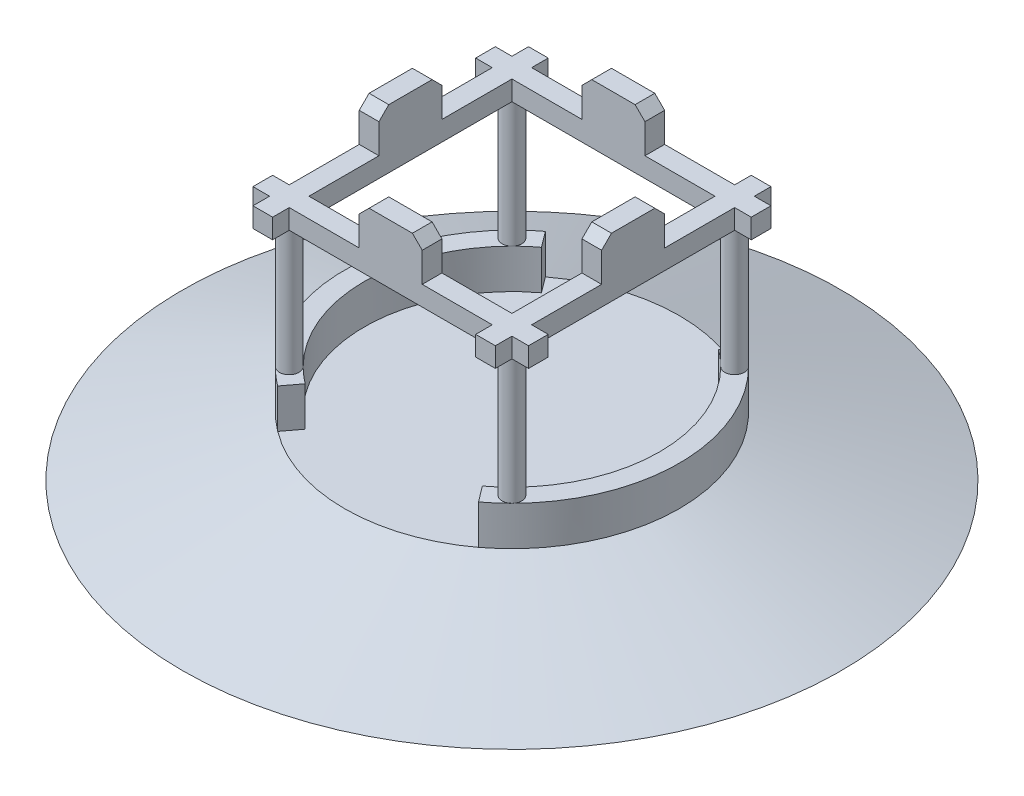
ISO-10303-21;
HEADER;
FILE_DESCRIPTION(('STEP AP214'),'2;1');
FILE_NAME('part.step','',(''),(''),'','','');
FILE_SCHEMA(('AUTOMOTIVE_DESIGN { 1 0 10303 214 1 1 1 1 }'));
ENDSEC;
DATA;
#1=APPLICATION_CONTEXT('core data for automotive mechanical design processes');
#2=APPLICATION_PROTOCOL_DEFINITION('international standard','automotive_design',2000,#1);
#3=PRODUCT_CONTEXT('',#1,'mechanical');
#4=PRODUCT('Part','Part','',(#3));
#5=PRODUCT_RELATED_PRODUCT_CATEGORY('part','',(#4));
#6=PRODUCT_DEFINITION_FORMATION('','',#4);
#7=PRODUCT_DEFINITION_CONTEXT('part definition',#1,'design');
#8=PRODUCT_DEFINITION('design','',#6,#7);
#9=PRODUCT_DEFINITION_SHAPE('','',#8);
#10=(LENGTH_UNIT() NAMED_UNIT(*) SI_UNIT(.MILLI.,.METRE.));
#11=(NAMED_UNIT(*) PLANE_ANGLE_UNIT() SI_UNIT($,.RADIAN.));
#12=(NAMED_UNIT(*) SI_UNIT($,.STERADIAN.) SOLID_ANGLE_UNIT());
#13=UNCERTAINTY_MEASURE_WITH_UNIT(LENGTH_MEASURE(1.E-05),#10,'distance_accuracy_value','');
#14=(GEOMETRIC_REPRESENTATION_CONTEXT(3) GLOBAL_UNCERTAINTY_ASSIGNED_CONTEXT((#13)) GLOBAL_UNIT_ASSIGNED_CONTEXT((#10,
#11,#12)) REPRESENTATION_CONTEXT('',''));
#15=CARTESIAN_POINT('',(0.,0.,0.));
#16=DIRECTION('',(0.,0.,1.));
#17=DIRECTION('',(1.,0.,0.));
#18=AXIS2_PLACEMENT_3D('',#15,#16,#17);
#19=CARTESIAN_POINT('',(615.685424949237,950.,700.));
#20=DIRECTION('',(-1.,0.,0.));
#21=DIRECTION('',(0.,0.,1.));
#22=AXIS2_PLACEMENT_3D('',#19,#20,#21);
#23=PLANE('',#22);
#24=DIRECTION('',(0.,1.,0.));
#25=VECTOR('',#24,1.);
#26=CARTESIAN_POINT('',(615.685424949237,950.,-615.68542494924));
#27=LINE('',#26,#25);
#28=CARTESIAN_POINT('',(615.685424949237,850.,-615.685424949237));
#29=VERTEX_POINT('',#28);
#30=CARTESIAN_POINT('',(615.685424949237,950.,-615.68542494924));
#31=VERTEX_POINT('',#30);
#32=EDGE_CURVE('E733',#29,#31,#27,.T.);
#33=ORIENTED_EDGE('',*,*,#32,.F.);
#34=DIRECTION('',(0.,0.,-1.));
#35=VECTOR('',#34,1.);
#36=CARTESIAN_POINT('',(615.685424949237,850.,700.));
#37=LINE('',#36,#35);
#38=CARTESIAN_POINT('',(615.685424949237,850.,-700.));
#39=VERTEX_POINT('',#38);
#40=EDGE_CURVE('E757',#29,#39,#37,.T.);
#41=ORIENTED_EDGE('',*,*,#40,.T.);
#42=DIRECTION('',(0.,-1.,0.));
#43=VECTOR('',#42,1.);
#44=CARTESIAN_POINT('',(615.685424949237,950.,-700.));
#45=LINE('',#44,#43);
#46=CARTESIAN_POINT('',(615.685424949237,950.,-700.));
#47=VERTEX_POINT('',#46);
#48=EDGE_CURVE('E794',#47,#39,#45,.T.);
#49=ORIENTED_EDGE('',*,*,#48,.F.);
#50=DIRECTION('',(0.,0.,-1.));
#51=VECTOR('',#50,1.);
#52=CARTESIAN_POINT('',(615.685424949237,950.,700.));
#53=LINE('',#52,#51);
#54=EDGE_CURVE('E53',#31,#47,#53,.T.);
#55=ORIENTED_EDGE('',*,*,#54,.F.);
#56=EDGE_LOOP('',(#33,#41,#49,#55));
#57=FACE_BOUND('',#56,.T.);
#58=ADVANCED_FACE('F38',(#57),#23,.F.);
#59=DIRECTION('',(0.,-1.,0.));
#60=VECTOR('',#59,1.);
#61=CARTESIAN_POINT('',(615.685424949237,950.,-515.685424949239));
#62=LINE('',#61,#60);
#63=CARTESIAN_POINT('',(615.685424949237,950.,-515.685424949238));
#64=VERTEX_POINT('',#63);
#65=CARTESIAN_POINT('',(615.685424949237,850.,-515.685424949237));
#66=VERTEX_POINT('',#65);
#67=EDGE_CURVE('E61',#64,#66,#62,.T.);
#68=ORIENTED_EDGE('',*,*,#67,.F.);
#69=CARTESIAN_POINT('',(615.685424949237,950.,-160.));
#70=VERTEX_POINT('',#69);
#71=EDGE_CURVE('E763',#70,#64,#53,.T.);
#72=ORIENTED_EDGE('',*,*,#71,.F.);
#73=DIRECTION('',(0.,-1.,0.));
#74=VECTOR('',#73,1.);
#75=CARTESIAN_POINT('',(615.685424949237,1150.,-160.));
#76=LINE('',#75,#74);
#77=CARTESIAN_POINT('',(615.685424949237,1100.,-160.));
#78=VERTEX_POINT('',#77);
#79=EDGE_CURVE('E755',#78,#70,#76,.T.);
#80=ORIENTED_EDGE('',*,*,#79,.F.);
#81=DIRECTION('',(0.,0.707106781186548,0.707106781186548));
#82=VECTOR('',#81,1.);
#83=CARTESIAN_POINT('',(615.685424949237,1150.,-110.));
#84=LINE('',#83,#82);
#85=CARTESIAN_POINT('',(615.685424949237,1150.,-110.));
#86=VERTEX_POINT('',#85);
#87=EDGE_CURVE('E915',#78,#86,#84,.T.);
#88=ORIENTED_EDGE('',*,*,#87,.T.);
#89=DIRECTION('',(0.,0.,-1.));
#90=VECTOR('',#89,1.);
#91=CARTESIAN_POINT('',(615.685424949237,1150.,-160.));
#92=LINE('',#91,#90);
#93=CARTESIAN_POINT('',(615.685424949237,1150.,110.));
#94=VERTEX_POINT('',#93);
#95=EDGE_CURVE('E736',#94,#86,#92,.T.);
#96=ORIENTED_EDGE('',*,*,#95,.F.);
#97=DIRECTION('',(0.,-0.707106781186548,0.707106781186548));
#98=VECTOR('',#97,1.);
#99=CARTESIAN_POINT('',(615.685424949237,1150.,110.));
#100=LINE('',#99,#98);
#101=CARTESIAN_POINT('',(615.685424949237,1100.,160.));
#102=VERTEX_POINT('',#101);
#103=EDGE_CURVE('E913',#94,#102,#100,.T.);
#104=ORIENTED_EDGE('',*,*,#103,.T.);
#105=DIRECTION('',(0.,-1.,0.));
#106=VECTOR('',#105,1.);
#107=CARTESIAN_POINT('',(615.685424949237,1150.,160.));
#108=LINE('',#107,#106);
#109=CARTESIAN_POINT('',(615.685424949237,950.,160.));
#110=VERTEX_POINT('',#109);
#111=EDGE_CURVE('E743',#102,#110,#108,.T.);
#112=ORIENTED_EDGE('',*,*,#111,.T.);
#113=CARTESIAN_POINT('',(615.685424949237,950.,515.68542494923));
#114=VERTEX_POINT('',#113);
#115=EDGE_CURVE('E762',#114,#110,#53,.T.);
#116=ORIENTED_EDGE('',*,*,#115,.F.);
#117=DIRECTION('',(0.,1.,0.));
#118=VECTOR('',#117,1.);
#119=CARTESIAN_POINT('',(615.685424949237,950.,515.685424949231));
#120=LINE('',#119,#118);
#121=CARTESIAN_POINT('',(615.685424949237,850.,515.685424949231));
#122=VERTEX_POINT('',#121);
#123=EDGE_CURVE('E729',#122,#114,#120,.T.);
#124=ORIENTED_EDGE('',*,*,#123,.F.);
#125=EDGE_CURVE('E778',#122,#66,#37,.T.);
#126=ORIENTED_EDGE('',*,*,#125,.T.);
#127=EDGE_LOOP('',(#68,#72,#80,#88,#96,#104,#112,#116,#124,#126));
#128=FACE_BOUND('',#127,.T.);
#129=ADVANCED_FACE('F976',(#128),#23,.F.);
#130=DIRECTION('',(0.,-1.,0.));
#131=VECTOR('',#130,1.);
#132=CARTESIAN_POINT('',(615.685424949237,950.,615.685424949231));
#133=LINE('',#132,#131);
#134=CARTESIAN_POINT('',(615.685424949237,950.,615.685424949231));
#135=VERTEX_POINT('',#134);
#136=CARTESIAN_POINT('',(615.685424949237,850.,615.685424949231));
#137=VERTEX_POINT('',#136);
#138=EDGE_CURVE('E727',#135,#137,#133,.T.);
#139=ORIENTED_EDGE('',*,*,#138,.F.);
#140=CARTESIAN_POINT('',(615.685424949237,950.,700.));
#141=VERTEX_POINT('',#140);
#142=EDGE_CURVE('E758',#141,#135,#53,.T.);
#143=ORIENTED_EDGE('',*,*,#142,.F.);
#144=DIRECTION('',(0.,-1.,0.));
#145=VECTOR('',#144,1.);
#146=CARTESIAN_POINT('',(615.685424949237,950.,700.));
#147=LINE('',#146,#145);
#148=CARTESIAN_POINT('',(615.685424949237,850.,700.));
#149=VERTEX_POINT('',#148);
#150=EDGE_CURVE('E773',#141,#149,#147,.T.);
#151=ORIENTED_EDGE('',*,*,#150,.T.);
#152=EDGE_CURVE('E774',#149,#137,#37,.T.);
#153=ORIENTED_EDGE('',*,*,#152,.T.);
#154=EDGE_LOOP('',(#139,#143,#151,#153));
#155=FACE_BOUND('',#154,.T.);
#156=ADVANCED_FACE('F978',(#155),#23,.F.);
#157=CARTESIAN_POINT('',(515.685424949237,950.,700.));
#158=DIRECTION('',(1.,0.,0.));
#159=DIRECTION('',(0.,0.,-1.));
#160=AXIS2_PLACEMENT_3D('',#157,#158,#159);
#161=PLANE('',#160);
#162=DIRECTION('',(0.,-1.,0.));
#163=VECTOR('',#162,1.);
#164=CARTESIAN_POINT('',(515.685424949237,950.,-615.685424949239));
#165=LINE('',#164,#163);
#166=CARTESIAN_POINT('',(515.685424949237,950.,-615.68542494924));
#167=VERTEX_POINT('',#166);
#168=CARTESIAN_POINT('',(515.685424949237,850.,-615.685424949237));
#169=VERTEX_POINT('',#168);
#170=EDGE_CURVE('E11',#167,#169,#165,.T.);
#171=ORIENTED_EDGE('',*,*,#170,.F.);
#172=DIRECTION('',(0.,0.,1.));
#173=VECTOR('',#172,1.);
#174=CARTESIAN_POINT('',(515.685424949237,950.,700.));
#175=LINE('',#174,#173);
#176=CARTESIAN_POINT('',(515.685424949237,950.,-700.));
#177=VERTEX_POINT('',#176);
#178=EDGE_CURVE('E766',#177,#167,#175,.T.);
#179=ORIENTED_EDGE('',*,*,#178,.F.);
#180=DIRECTION('',(0.,-1.,0.));
#181=VECTOR('',#180,1.);
#182=CARTESIAN_POINT('',(515.685424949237,950.,-700.));
#183=LINE('',#182,#181);
#184=CARTESIAN_POINT('',(515.685424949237,850.,-700.));
#185=VERTEX_POINT('',#184);
#186=EDGE_CURVE('E791',#177,#185,#183,.T.);
#187=ORIENTED_EDGE('',*,*,#186,.T.);
#188=DIRECTION('',(0.,0.,1.));
#189=VECTOR('',#188,1.);
#190=CARTESIAN_POINT('',(515.685424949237,850.,700.));
#191=LINE('',#190,#189);
#192=EDGE_CURVE('E781',#185,#169,#191,.T.);
#193=ORIENTED_EDGE('',*,*,#192,.T.);
#194=EDGE_LOOP('',(#171,#179,#187,#193));
#195=FACE_BOUND('',#194,.T.);
#196=ADVANCED_FACE('F985',(#195),#161,.F.);
#197=DIRECTION('',(0.,1.,0.));
#198=VECTOR('',#197,1.);
#199=CARTESIAN_POINT('',(515.685424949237,950.,-515.685424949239));
#200=LINE('',#199,#198);
#201=CARTESIAN_POINT('',(515.685424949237,850.,-515.685424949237));
#202=VERTEX_POINT('',#201);
#203=CARTESIAN_POINT('',(515.685424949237,950.,-515.685424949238));
#204=VERTEX_POINT('',#203);
#205=EDGE_CURVE('E46',#202,#204,#200,.T.);
#206=ORIENTED_EDGE('',*,*,#205,.F.);
#207=CARTESIAN_POINT('',(515.685424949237,850.,515.685424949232));
#208=VERTEX_POINT('',#207);
#209=EDGE_CURVE('E784',#202,#208,#191,.T.);
#210=ORIENTED_EDGE('',*,*,#209,.T.);
#211=DIRECTION('',(0.,-1.,0.));
#212=VECTOR('',#211,1.);
#213=CARTESIAN_POINT('',(515.685424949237,950.,515.685424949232));
#214=LINE('',#213,#212);
#215=CARTESIAN_POINT('',(515.685424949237,950.,515.685424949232));
#216=VERTEX_POINT('',#215);
#217=EDGE_CURVE('E919',#216,#208,#214,.T.);
#218=ORIENTED_EDGE('',*,*,#217,.F.);
#219=CARTESIAN_POINT('',(515.685424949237,950.,160.));
#220=VERTEX_POINT('',#219);
#221=EDGE_CURVE('E771',#220,#216,#175,.T.);
#222=ORIENTED_EDGE('',*,*,#221,.F.);
#223=DIRECTION('',(0.,-1.,0.));
#224=VECTOR('',#223,1.);
#225=CARTESIAN_POINT('',(515.685424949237,1150.,160.));
#226=LINE('',#225,#224);
#227=CARTESIAN_POINT('',(515.685424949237,1100.,160.));
#228=VERTEX_POINT('',#227);
#229=EDGE_CURVE('E750',#228,#220,#226,.T.);
#230=ORIENTED_EDGE('',*,*,#229,.F.);
#231=DIRECTION('',(0.,0.707106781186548,-0.707106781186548));
#232=VECTOR('',#231,1.);
#233=CARTESIAN_POINT('',(515.685424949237,1150.,110.));
#234=LINE('',#233,#232);
#235=CARTESIAN_POINT('',(515.685424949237,1150.,110.));
#236=VERTEX_POINT('',#235);
#237=EDGE_CURVE('E907',#228,#236,#234,.T.);
#238=ORIENTED_EDGE('',*,*,#237,.T.);
#239=DIRECTION('',(0.,0.,1.));
#240=VECTOR('',#239,1.);
#241=CARTESIAN_POINT('',(515.685424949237,1150.,-160.));
#242=LINE('',#241,#240);
#243=CARTESIAN_POINT('',(515.685424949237,1150.,-110.));
#244=VERTEX_POINT('',#243);
#245=EDGE_CURVE('E739',#244,#236,#242,.T.);
#246=ORIENTED_EDGE('',*,*,#245,.F.);
#247=DIRECTION('',(0.,-0.707106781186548,-0.707106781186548));
#248=VECTOR('',#247,1.);
#249=CARTESIAN_POINT('',(515.685424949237,1150.,-110.));
#250=LINE('',#249,#248);
#251=CARTESIAN_POINT('',(515.685424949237,1100.,-160.));
#252=VERTEX_POINT('',#251);
#253=EDGE_CURVE('E909',#244,#252,#250,.T.);
#254=ORIENTED_EDGE('',*,*,#253,.T.);
#255=DIRECTION('',(0.,-1.,0.));
#256=VECTOR('',#255,1.);
#257=CARTESIAN_POINT('',(515.685424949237,1150.,-160.));
#258=LINE('',#257,#256);
#259=CARTESIAN_POINT('',(515.685424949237,950.,-160.));
#260=VERTEX_POINT('',#259);
#261=EDGE_CURVE('E752',#252,#260,#258,.T.);
#262=ORIENTED_EDGE('',*,*,#261,.T.);
#263=EDGE_CURVE('E770',#204,#260,#175,.T.);
#264=ORIENTED_EDGE('',*,*,#263,.F.);
#265=EDGE_LOOP('',(#206,#210,#218,#222,#230,#238,#246,#254,#262,#264));
#266=FACE_BOUND('',#265,.T.);
#267=ADVANCED_FACE('F990',(#266),#161,.F.);
#268=DIRECTION('',(0.,1.,0.));
#269=VECTOR('',#268,1.);
#270=CARTESIAN_POINT('',(515.685424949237,950.,615.685424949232));
#271=LINE('',#270,#269);
#272=CARTESIAN_POINT('',(515.685424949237,850.,615.685424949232));
#273=VERTEX_POINT('',#272);
#274=CARTESIAN_POINT('',(515.685424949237,950.,615.685424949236));
#275=VERTEX_POINT('',#274);
#276=EDGE_CURVE('E724',#273,#275,#271,.T.);
#277=ORIENTED_EDGE('',*,*,#276,.F.);
#278=CARTESIAN_POINT('',(515.685424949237,850.,700.));
#279=VERTEX_POINT('',#278);
#280=EDGE_CURVE('E780',#273,#279,#191,.T.);
#281=ORIENTED_EDGE('',*,*,#280,.T.);
#282=DIRECTION('',(0.,-1.,0.));
#283=VECTOR('',#282,1.);
#284=CARTESIAN_POINT('',(515.685424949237,950.,700.));
#285=LINE('',#284,#283);
#286=CARTESIAN_POINT('',(515.685424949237,950.,700.));
#287=VERTEX_POINT('',#286);
#288=EDGE_CURVE('E788',#287,#279,#285,.T.);
#289=ORIENTED_EDGE('',*,*,#288,.F.);
#290=EDGE_CURVE('E765',#275,#287,#175,.T.);
#291=ORIENTED_EDGE('',*,*,#290,.F.);
#292=EDGE_LOOP('',(#277,#281,#289,#291));
#293=FACE_BOUND('',#292,.T.);
#294=ADVANCED_FACE('F993',(#293),#161,.F.);
#295=CARTESIAN_POINT('',(0.,950.,0.));
#296=DIRECTION('',(0.,-1.,0.));
#297=DIRECTION('',(0.,0.,-1.));
#298=AXIS2_PLACEMENT_3D('',#295,#296,#297);
#299=PLANE('',#298);
#300=DIRECTION('',(1.,0.,0.));
#301=VECTOR('',#300,1.);
#302=CARTESIAN_POINT('',(-699.999999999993,950.,615.685424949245));
#303=LINE('',#302,#301);
#304=CARTESIAN_POINT('',(160.000000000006,950.,615.685424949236));
#305=VERTEX_POINT('',#304);
#306=EDGE_CURVE('E501',#305,#275,#303,.T.);
#307=ORIENTED_EDGE('',*,*,#306,.T.);
#308=ORIENTED_EDGE('',*,*,#290,.T.);
#309=DIRECTION('',(1.,0.,0.));
#310=VECTOR('',#309,1.);
#311=CARTESIAN_POINT('',(515.685424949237,950.,700.));
#312=LINE('',#311,#310);
#313=EDGE_CURVE('E769',#287,#141,#312,.T.);
#314=ORIENTED_EDGE('',*,*,#313,.T.);
#315=ORIENTED_EDGE('',*,*,#142,.T.);
#316=CARTESIAN_POINT('',(700.000000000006,950.,615.68542494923));
#317=VERTEX_POINT('',#316);
#318=EDGE_CURVE('E500',#135,#317,#303,.T.);
#319=ORIENTED_EDGE('',*,*,#318,.T.);
#320=DIRECTION('',(0.,0.,-1.));
#321=VECTOR('',#320,1.);
#322=CARTESIAN_POINT('',(700.000000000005,950.,515.68542494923));
#323=LINE('',#322,#321);
#324=CARTESIAN_POINT('',(700.000000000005,950.,515.68542494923));
#325=VERTEX_POINT('',#324);
#326=EDGE_CURVE('E516',#317,#325,#323,.T.);
#327=ORIENTED_EDGE('',*,*,#326,.T.);
#328=DIRECTION('',(-1.,0.,0.));
#329=VECTOR('',#328,1.);
#330=CARTESIAN_POINT('',(-699.999999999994,950.,515.685424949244));
#331=LINE('',#330,#329);
#332=EDGE_CURVE('E1067',#325,#114,#331,.T.);
#333=ORIENTED_EDGE('',*,*,#332,.T.);
#334=ORIENTED_EDGE('',*,*,#115,.T.);
#335=DIRECTION('',(1.,0.,0.));
#336=VECTOR('',#335,1.);
#337=CARTESIAN_POINT('',(515.685424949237,950.,160.));
#338=LINE('',#337,#336);
#339=EDGE_CURVE('E740',#220,#110,#338,.T.);
#340=ORIENTED_EDGE('',*,*,#339,.F.);
#341=ORIENTED_EDGE('',*,*,#221,.T.);
#342=CARTESIAN_POINT('',(160.000000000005,950.,515.685424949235));
#343=VERTEX_POINT('',#342);
#344=EDGE_CURVE('E1068',#216,#343,#331,.T.);
#345=ORIENTED_EDGE('',*,*,#344,.T.);
#346=DIRECTION('',(0.,0.,-1.));
#347=VECTOR('',#346,1.);
#348=CARTESIAN_POINT('',(160.000000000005,950.,515.685424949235));
#349=LINE('',#348,#347);
#350=EDGE_CURVE('E513',#305,#343,#349,.T.);
#351=ORIENTED_EDGE('',*,*,#350,.F.);
#352=EDGE_LOOP('',(#307,#308,#314,#315,#319,#327,#333,#334,#340,#341,#345,#351));
#353=FACE_BOUND('',#352,.T.);
#354=ADVANCED_FACE('F1000',(#353),#299,.F.);
#355=DIRECTION('',(1.,0.,0.));
#356=VECTOR('',#355,1.);
#357=CARTESIAN_POINT('',(699.999999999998,950.,-515.68542494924));
#358=LINE('',#357,#356);
#359=CARTESIAN_POINT('',(159.999999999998,950.,-515.685424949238));
#360=VERTEX_POINT('',#359);
#361=EDGE_CURVE('E652',#360,#204,#358,.T.);
#362=ORIENTED_EDGE('',*,*,#361,.T.);
#363=ORIENTED_EDGE('',*,*,#263,.T.);
#364=DIRECTION('',(-1.,0.,0.));
#365=VECTOR('',#364,1.);
#366=CARTESIAN_POINT('',(515.685424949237,950.,-160.));
#367=LINE('',#366,#365);
#368=EDGE_CURVE('E735',#70,#260,#367,.T.);
#369=ORIENTED_EDGE('',*,*,#368,.F.);
#370=ORIENTED_EDGE('',*,*,#71,.T.);
#371=CARTESIAN_POINT('',(699.999999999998,950.,-515.68542494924));
#372=VERTEX_POINT('',#371);
#373=EDGE_CURVE('E651',#64,#372,#358,.T.);
#374=ORIENTED_EDGE('',*,*,#373,.T.);
#375=DIRECTION('',(0.,0.,-1.));
#376=VECTOR('',#375,1.);
#377=CARTESIAN_POINT('',(699.999999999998,950.,-515.68542494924));
#378=LINE('',#377,#376);
#379=CARTESIAN_POINT('',(699.999999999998,950.,-615.68542494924));
#380=VERTEX_POINT('',#379);
#381=EDGE_CURVE('E715',#372,#380,#378,.T.);
#382=ORIENTED_EDGE('',*,*,#381,.T.);
#383=DIRECTION('',(-1.,0.,0.));
#384=VECTOR('',#383,1.);
#385=CARTESIAN_POINT('',(699.999999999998,950.,-615.68542494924));
#386=LINE('',#385,#384);
#387=EDGE_CURVE('E685',#380,#31,#386,.T.);
#388=ORIENTED_EDGE('',*,*,#387,.T.);
#389=ORIENTED_EDGE('',*,*,#54,.T.);
#390=DIRECTION('',(-1.,0.,0.));
#391=VECTOR('',#390,1.);
#392=CARTESIAN_POINT('',(515.685424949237,950.,-700.));
#393=LINE('',#392,#391);
#394=EDGE_CURVE('E761',#47,#177,#393,.T.);
#395=ORIENTED_EDGE('',*,*,#394,.T.);
#396=ORIENTED_EDGE('',*,*,#178,.T.);
#397=CARTESIAN_POINT('',(159.999999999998,950.,-615.685424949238));
#398=VERTEX_POINT('',#397);
#399=EDGE_CURVE('E684',#167,#398,#386,.T.);
#400=ORIENTED_EDGE('',*,*,#399,.T.);
#401=DIRECTION('',(0.,0.,-1.));
#402=VECTOR('',#401,1.);
#403=CARTESIAN_POINT('',(159.999999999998,950.,-515.685424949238));
#404=LINE('',#403,#402);
#405=EDGE_CURVE('E673',#360,#398,#404,.T.);
#406=ORIENTED_EDGE('',*,*,#405,.F.);
#407=EDGE_LOOP('',(#362,#363,#369,#370,#374,#382,#388,#389,#395,#396,#400,#406));
#408=FACE_BOUND('',#407,.T.);
#409=ADVANCED_FACE('F931',(#408),#299,.F.);
#410=CARTESIAN_POINT('',(0.,200.,0.));
#411=DIRECTION('',(0.,1.,0.));
#412=DIRECTION('',(0.,0.,1.));
#413=AXIS2_PLACEMENT_3D('',#410,#411,#412);
#414=PLANE('',#413);
#415=CARTESIAN_POINT('',(0.,200.,0.));
#416=DIRECTION('',(0.,1.,0.));
#417=DIRECTION('',(0.,0.,1.));
#418=AXIS2_PLACEMENT_3D('',#415,#416,#417);
#419=CIRCLE('',#418,850.);
#420=CARTESIAN_POINT('',(-601.040764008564,200.,-601.040764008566));
#421=VERTEX_POINT('',#420);
#422=CARTESIAN_POINT('',(-601.04076400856,200.,601.040764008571));
#423=VERTEX_POINT('',#422);
#424=EDGE_CURVE('E872',#421,#423,#419,.T.);
#425=ORIENTED_EDGE('',*,*,#424,.T.);
#426=CARTESIAN_POINT('',(-565.685424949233,200.,565.685424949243));
#427=DIRECTION('',(0.,1.,0.));
#428=DIRECTION('',(-1.,0.,0.));
#429=AXIS2_PLACEMENT_3D('',#426,#427,#428);
#430=CIRCLE('',#429,50.);
#431=CARTESIAN_POINT('',(-530.330085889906,200.,530.330085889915));
#432=VERTEX_POINT('',#431);
#433=EDGE_CURVE('E797',#432,#423,#430,.T.);
#434=ORIENTED_EDGE('',*,*,#433,.F.);
#435=CARTESIAN_POINT('',(0.,200.,0.));
#436=DIRECTION('',(0.,1.,0.));
#437=DIRECTION('',(0.,0.,1.));
#438=AXIS2_PLACEMENT_3D('',#435,#436,#437);
#439=CIRCLE('',#438,750.);
#440=CARTESIAN_POINT('',(-530.33008588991,200.,-530.330085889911));
#441=VERTEX_POINT('',#440);
#442=EDGE_CURVE('E865',#441,#432,#439,.T.);
#443=ORIENTED_EDGE('',*,*,#442,.F.);
#444=CARTESIAN_POINT('',(-565.685424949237,200.,-565.685424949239));
#445=DIRECTION('',(0.,1.,0.));
#446=DIRECTION('',(0.,0.,-1.));
#447=AXIS2_PLACEMENT_3D('',#444,#445,#446);
#448=CIRCLE('',#447,50.);
#449=EDGE_CURVE('E803',#421,#441,#448,.T.);
#450=ORIENTED_EDGE('',*,*,#449,.F.);
#451=EDGE_LOOP('',(#425,#434,#443,#450));
#452=FACE_BOUND('',#451,.T.);
#453=ADVANCED_FACE('F1370',(#452),#414,.T.);
#454=CARTESIAN_POINT('',(-450.,200.,600.));
#455=VERTEX_POINT('',#454);
#456=EDGE_CURVE('E866',#432,#455,#439,.T.);
#457=ORIENTED_EDGE('',*,*,#456,.F.);
#458=EDGE_CURVE('E798',#423,#432,#430,.T.);
#459=ORIENTED_EDGE('',*,*,#458,.F.);
#460=CARTESIAN_POINT('',(-510.,200.,680.));
#461=VERTEX_POINT('',#460);
#462=EDGE_CURVE('E868',#423,#461,#419,.T.);
#463=ORIENTED_EDGE('',*,*,#462,.T.);
#464=DIRECTION('',(-0.6,0.,0.8));
#465=VECTOR('',#464,1.);
#466=CARTESIAN_POINT('',(0.,200.,0.));
#467=LINE('',#466,#465);
#468=EDGE_CURVE('E871',#455,#461,#467,.T.);
#469=ORIENTED_EDGE('',*,*,#468,.F.);
#470=EDGE_LOOP('',(#457,#459,#463,#469));
#471=FACE_BOUND('',#470,.T.);
#472=ADVANCED_FACE('F1765',(#471),#414,.T.);
#473=CARTESIAN_POINT('',(0.,200.,0.));
#474=DIRECTION('',(0.,1.,0.));
#475=DIRECTION('',(0.,0.,1.));
#476=AXIS2_PLACEMENT_3D('',#473,#474,#475);
#477=PLANE('',#476);
#478=CARTESIAN_POINT('',(0.,200.,0.));
#479=DIRECTION('',(0.,1.,0.));
#480=DIRECTION('',(0.,0.,1.));
#481=AXIS2_PLACEMENT_3D('',#478,#479,#480);
#482=CIRCLE('',#481,750.);
#483=CARTESIAN_POINT('',(530.33008588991,200.,-530.330085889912));
#484=VERTEX_POINT('',#483);
#485=CARTESIAN_POINT('',(450.000000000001,200.,-600.));
#486=VERTEX_POINT('',#485);
#487=EDGE_CURVE('E829',#484,#486,#482,.T.);
#488=ORIENTED_EDGE('',*,*,#487,.F.);
#489=CARTESIAN_POINT('',(565.685424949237,200.,-565.685424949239));
#490=DIRECTION('',(0.,1.,0.));
#491=DIRECTION('',(1.,0.,0.));
#492=AXIS2_PLACEMENT_3D('',#489,#490,#491);
#493=CIRCLE('',#492,50.);
#494=CARTESIAN_POINT('',(601.040764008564,200.,-601.040764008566));
#495=VERTEX_POINT('',#494);
#496=EDGE_CURVE('E811',#495,#484,#493,.T.);
#497=ORIENTED_EDGE('',*,*,#496,.F.);
#498=CARTESIAN_POINT('',(0.,200.,0.));
#499=DIRECTION('',(0.,1.,0.));
#500=DIRECTION('',(0.,0.,1.));
#501=AXIS2_PLACEMENT_3D('',#498,#499,#500);
#502=CIRCLE('',#501,850.);
#503=CARTESIAN_POINT('',(510.,200.,-680.));
#504=VERTEX_POINT('',#503);
#505=EDGE_CURVE('E831',#495,#504,#502,.T.);
#506=ORIENTED_EDGE('',*,*,#505,.T.);
#507=DIRECTION('',(0.599999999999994,0.,-0.800000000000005));
#508=VECTOR('',#507,1.);
#509=CARTESIAN_POINT('',(5.4178883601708E-12,200.,4.06341627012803E-12));
#510=LINE('',#509,#508);
#511=EDGE_CURVE('E834',#486,#504,#510,.T.);
#512=ORIENTED_EDGE('',*,*,#511,.F.);
#513=EDGE_LOOP('',(#488,#497,#506,#512));
#514=FACE_BOUND('',#513,.T.);
#515=ADVANCED_FACE('F1803',(#514),#477,.T.);
#516=CARTESIAN_POINT('',(601.040764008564,200.,601.040764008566));
#517=VERTEX_POINT('',#516);
#518=EDGE_CURVE('E835',#517,#495,#502,.T.);
#519=ORIENTED_EDGE('',*,*,#518,.T.);
#520=EDGE_CURVE('E810',#484,#495,#493,.T.);
#521=ORIENTED_EDGE('',*,*,#520,.F.);
#522=CARTESIAN_POINT('',(530.33008588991,200.,530.330085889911));
#523=VERTEX_POINT('',#522);
#524=EDGE_CURVE('E828',#523,#484,#482,.T.);
#525=ORIENTED_EDGE('',*,*,#524,.F.);
#526=CARTESIAN_POINT('',(565.685424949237,200.,565.685424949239));
#527=DIRECTION('',(0.,1.,0.));
#528=DIRECTION('',(0.,0.,1.));
#529=AXIS2_PLACEMENT_3D('',#526,#527,#528);
#530=CIRCLE('',#529,50.);
#531=EDGE_CURVE('E816',#517,#523,#530,.T.);
#532=ORIENTED_EDGE('',*,*,#531,.F.);
#533=EDGE_LOOP('',(#519,#521,#525,#532));
#534=FACE_BOUND('',#533,.T.);
#535=ADVANCED_FACE('F1798',(#534),#477,.T.);
#536=CARTESIAN_POINT('',(0.,0.,0.));
#537=DIRECTION('',(0.,1.,0.));
#538=DIRECTION('',(0.,0.,1.));
#539=AXIS2_PLACEMENT_3D('',#536,#537,#538);
#540=PLANE('',#539);
#541=CARTESIAN_POINT('',(0.,-1.11022302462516E-13,0.));
#542=DIRECTION('',(0.,1.,0.));
#543=DIRECTION('',(0.,0.,1.));
#544=AXIS2_PLACEMENT_3D('',#541,#542,#543);
#545=CIRCLE('',#544,850.);
#546=CARTESIAN_POINT('',(-510.,-1.11022302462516E-13,680.));
#547=VERTEX_POINT('',#546);
#548=CARTESIAN_POINT('',(510.,-1.11022302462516E-13,680.));
#549=VERTEX_POINT('',#548);
#550=EDGE_CURVE('E900',#547,#549,#545,.T.);
#551=ORIENTED_EDGE('',*,*,#550,.T.);
#552=DIRECTION('',(0.599999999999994,0.,0.800000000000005));
#553=VECTOR('',#552,1.);
#554=CARTESIAN_POINT('',(5.4178883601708E-12,0.,-4.06341627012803E-12));
#555=LINE('',#554,#553);
#556=CARTESIAN_POINT('',(450.000000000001,0.,600.));
#557=VERTEX_POINT('',#556);
#558=EDGE_CURVE('E840',#557,#549,#555,.T.);
#559=ORIENTED_EDGE('',*,*,#558,.F.);
#560=CARTESIAN_POINT('',(0.,0.,0.));
#561=DIRECTION('',(0.,1.,0.));
#562=DIRECTION('',(0.,0.,1.));
#563=AXIS2_PLACEMENT_3D('',#560,#561,#562);
#564=CIRCLE('',#563,750.);
#565=CARTESIAN_POINT('',(450.,0.,-600.));
#566=VERTEX_POINT('',#565);
#567=EDGE_CURVE('E820',#557,#566,#564,.T.);
#568=ORIENTED_EDGE('',*,*,#567,.T.);
#569=DIRECTION('',(0.599999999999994,0.,-0.800000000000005));
#570=VECTOR('',#569,1.);
#571=CARTESIAN_POINT('',(5.4178883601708E-12,0.,4.06341627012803E-12));
#572=LINE('',#571,#570);
#573=CARTESIAN_POINT('',(510.,0.,-680.));
#574=VERTEX_POINT('',#573);
#575=EDGE_CURVE('E846',#566,#574,#572,.T.);
#576=ORIENTED_EDGE('',*,*,#575,.T.);
#577=CARTESIAN_POINT('',(-510.,0.,-680.));
#578=VERTEX_POINT('',#577);
#579=EDGE_CURVE('E896',#574,#578,#545,.T.);
#580=ORIENTED_EDGE('',*,*,#579,.T.);
#581=DIRECTION('',(-0.6,0.,-0.8));
#582=VECTOR('',#581,1.);
#583=CARTESIAN_POINT('',(0.,0.,0.));
#584=LINE('',#583,#582);
#585=CARTESIAN_POINT('',(-450.,0.,-600.));
#586=VERTEX_POINT('',#585);
#587=EDGE_CURVE('E877',#586,#578,#584,.T.);
#588=ORIENTED_EDGE('',*,*,#587,.F.);
#589=CARTESIAN_POINT('',(0.,0.,0.));
#590=DIRECTION('',(0.,1.,0.));
#591=DIRECTION('',(0.,0.,1.));
#592=AXIS2_PLACEMENT_3D('',#589,#590,#591);
#593=CIRCLE('',#592,750.);
#594=CARTESIAN_POINT('',(-450.,0.,600.));
#595=VERTEX_POINT('',#594);
#596=EDGE_CURVE('E860',#586,#595,#593,.T.);
#597=ORIENTED_EDGE('',*,*,#596,.T.);
#598=DIRECTION('',(-0.6,0.,0.8));
#599=VECTOR('',#598,1.);
#600=CARTESIAN_POINT('',(0.,0.,0.));
#601=LINE('',#600,#599);
#602=EDGE_CURVE('E880',#595,#547,#601,.T.);
#603=ORIENTED_EDGE('',*,*,#602,.T.);
#604=EDGE_LOOP('',(#551,#559,#568,#576,#580,#588,#597,#603));
#605=FACE_BOUND('',#604,.T.);
#606=ADVANCED_FACE('F1802',(#605),#540,.T.);
#607=CARTESIAN_POINT('',(0.,-1.11022302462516E-13,0.));
#608=DIRECTION('',(0.,-1.,0.));
#609=DIRECTION('',(0.,0.,-1.));
#610=AXIS2_PLACEMENT_3D('',#607,#608,#609);
#611=CONICAL_SURFACE('',#610,850.,1.22173047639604);
#612=CARTESIAN_POINT('',(0.,-300.,0.));
#613=DIRECTION('',(0.,1.,0.));
#614=DIRECTION('',(0.,0.,1.));
#615=AXIS2_PLACEMENT_3D('',#612,#613,#614);
#616=CIRCLE('',#615,1674.2432258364);
#617=CARTESIAN_POINT('',(0.,-300.,1674.2432258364));
#618=VERTEX_POINT('',#617);
#619=EDGE_CURVE('E893',#618,#618,#616,.T.);
#620=ORIENTED_EDGE('',*,*,#619,.T.);
#621=EDGE_LOOP('',(#620));
#622=FACE_BOUND('',#621,.T.);
#623=EDGE_CURVE('E897',#578,#547,#545,.T.);
#624=ORIENTED_EDGE('',*,*,#623,.F.);
#625=ORIENTED_EDGE('',*,*,#579,.F.);
#626=CARTESIAN_POINT('',(0.,0.,0.));
#627=DIRECTION('',(0.,1.,0.));
#628=DIRECTION('',(0.,0.,1.));
#629=AXIS2_PLACEMENT_3D('',#626,#627,#628);
#630=CIRCLE('',#629,850.);
#631=EDGE_CURVE('E843',#549,#574,#630,.T.);
#632=ORIENTED_EDGE('',*,*,#631,.F.);
#633=ORIENTED_EDGE('',*,*,#550,.F.);
#634=EDGE_LOOP('',(#624,#625,#632,#633));
#635=FACE_BOUND('',#634,.T.);
#636=ADVANCED_FACE('F1866',(#622,#635),#611,.T.);
#637=CARTESIAN_POINT('',(-1674.2432258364,-300.,0.));
#638=DIRECTION('',(0.,-1.,0.));
#639=DIRECTION('',(0.,0.,-1.));
#640=AXIS2_PLACEMENT_3D('',#637,#638,#639);
#641=PLANE('',#640);
#642=ORIENTED_EDGE('',*,*,#619,.F.);
#643=EDGE_LOOP('',(#642));
#644=FACE_BOUND('',#643,.T.);
#645=ADVANCED_FACE('F1789',(#644),#641,.T.);
#646=CARTESIAN_POINT('',(0.,200.,0.));
#647=DIRECTION('',(0.,-1.,0.));
#648=DIRECTION('',(0.,0.,-1.));
#649=AXIS2_PLACEMENT_3D('',#646,#647,#648);
#650=CYLINDRICAL_SURFACE('',#649,750.);
#651=ORIENTED_EDGE('',*,*,#596,.F.);
#652=DIRECTION('',(0.,-1.,0.));
#653=VECTOR('',#652,1.);
#654=CARTESIAN_POINT('',(-450.,200.,-600.));
#655=LINE('',#654,#653);
#656=CARTESIAN_POINT('',(-450.,200.,-600.));
#657=VERTEX_POINT('',#656);
#658=EDGE_CURVE('E890',#657,#586,#655,.T.);
#659=ORIENTED_EDGE('',*,*,#658,.F.);
#660=EDGE_CURVE('E861',#657,#441,#439,.T.);
#661=ORIENTED_EDGE('',*,*,#660,.T.);
#662=ORIENTED_EDGE('',*,*,#442,.T.);
#663=ORIENTED_EDGE('',*,*,#456,.T.);
#664=DIRECTION('',(0.,-1.,0.));
#665=VECTOR('',#664,1.);
#666=CARTESIAN_POINT('',(-450.,200.,600.));
#667=LINE('',#666,#665);
#668=EDGE_CURVE('E875',#455,#595,#667,.T.);
#669=ORIENTED_EDGE('',*,*,#668,.T.);
#670=EDGE_LOOP('',(#651,#659,#661,#662,#663,#669));
#671=FACE_BOUND('',#670,.T.);
#672=ADVANCED_FACE('F1784',(#671),#650,.F.);
#673=CARTESIAN_POINT('',(0.,200.,0.));
#674=DIRECTION('',(-0.8,0.,0.6));
#675=DIRECTION('',(0.6,0.,0.8));
#676=AXIS2_PLACEMENT_3D('',#673,#674,#675);
#677=PLANE('',#676);
#678=ORIENTED_EDGE('',*,*,#587,.T.);
#679=DIRECTION('',(0.,-1.,0.));
#680=VECTOR('',#679,1.);
#681=CARTESIAN_POINT('',(-510.,200.,-680.));
#682=LINE('',#681,#680);
#683=CARTESIAN_POINT('',(-510.,200.,-680.));
#684=VERTEX_POINT('',#683);
#685=EDGE_CURVE('E887',#684,#578,#682,.T.);
#686=ORIENTED_EDGE('',*,*,#685,.F.);
#687=DIRECTION('',(-0.6,0.,-0.8));
#688=VECTOR('',#687,1.);
#689=CARTESIAN_POINT('',(0.,200.,0.));
#690=LINE('',#689,#688);
#691=EDGE_CURVE('E864',#657,#684,#690,.T.);
#692=ORIENTED_EDGE('',*,*,#691,.F.);
#693=ORIENTED_EDGE('',*,*,#658,.T.);
#694=EDGE_LOOP('',(#678,#686,#692,#693));
#695=FACE_BOUND('',#694,.T.);
#696=ADVANCED_FACE('F1776',(#695),#677,.F.);
#697=CARTESIAN_POINT('',(0.,200.,0.));
#698=DIRECTION('',(0.,-1.,0.));
#699=DIRECTION('',(0.,0.,-1.));
#700=AXIS2_PLACEMENT_3D('',#697,#698,#699);
#701=CYLINDRICAL_SURFACE('',#700,850.);
#702=ORIENTED_EDGE('',*,*,#623,.T.);
#703=DIRECTION('',(0.,-1.,0.));
#704=VECTOR('',#703,1.);
#705=CARTESIAN_POINT('',(-510.,200.,680.));
#706=LINE('',#705,#704);
#707=EDGE_CURVE('E884',#461,#547,#706,.T.);
#708=ORIENTED_EDGE('',*,*,#707,.F.);
#709=ORIENTED_EDGE('',*,*,#462,.F.);
#710=ORIENTED_EDGE('',*,*,#424,.F.);
#711=EDGE_CURVE('E869',#684,#421,#419,.T.);
#712=ORIENTED_EDGE('',*,*,#711,.F.);
#713=ORIENTED_EDGE('',*,*,#685,.T.);
#714=EDGE_LOOP('',(#702,#708,#709,#710,#712,#713));
#715=FACE_BOUND('',#714,.T.);
#716=ADVANCED_FACE('F1771',(#715),#701,.T.);
#717=CARTESIAN_POINT('',(0.,200.,0.));
#718=DIRECTION('',(0.8,0.,0.6));
#719=DIRECTION('',(0.6,0.,-0.8));
#720=AXIS2_PLACEMENT_3D('',#717,#718,#719);
#721=PLANE('',#720);
#722=ORIENTED_EDGE('',*,*,#602,.F.);
#723=ORIENTED_EDGE('',*,*,#668,.F.);
#724=ORIENTED_EDGE('',*,*,#468,.T.);
#725=ORIENTED_EDGE('',*,*,#707,.T.);
#726=EDGE_LOOP('',(#722,#723,#724,#725));
#727=FACE_BOUND('',#726,.T.);
#728=ADVANCED_FACE('F1762',(#727),#721,.T.);
#729=EDGE_CURVE('E807',#441,#421,#448,.T.);
#730=ORIENTED_EDGE('',*,*,#729,.F.);
#731=ORIENTED_EDGE('',*,*,#660,.F.);
#732=ORIENTED_EDGE('',*,*,#691,.T.);
#733=ORIENTED_EDGE('',*,*,#711,.T.);
#734=EDGE_LOOP('',(#730,#731,#732,#733));
#735=FACE_BOUND('',#734,.T.);
#736=ADVANCED_FACE('F1751',(#735),#414,.T.);
#737=CARTESIAN_POINT('',(0.,200.,0.));
#738=DIRECTION('',(0.,-1.,0.));
#739=DIRECTION('',(0.,0.,-1.));
#740=AXIS2_PLACEMENT_3D('',#737,#738,#739);
#741=CYLINDRICAL_SURFACE('',#740,750.);
#742=ORIENTED_EDGE('',*,*,#567,.F.);
#743=DIRECTION('',(0.,-1.,0.));
#744=VECTOR('',#743,1.);
#745=CARTESIAN_POINT('',(450.000000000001,200.,600.));
#746=LINE('',#745,#744);
#747=CARTESIAN_POINT('',(450.000000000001,200.,600.));
#748=VERTEX_POINT('',#747);
#749=EDGE_CURVE('E857',#748,#557,#746,.T.);
#750=ORIENTED_EDGE('',*,*,#749,.F.);
#751=EDGE_CURVE('E824',#748,#523,#482,.T.);
#752=ORIENTED_EDGE('',*,*,#751,.T.);
#753=ORIENTED_EDGE('',*,*,#524,.T.);
#754=ORIENTED_EDGE('',*,*,#487,.T.);
#755=DIRECTION('',(0.,-1.,0.));
#756=VECTOR('',#755,1.);
#757=CARTESIAN_POINT('',(450.000000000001,200.,-600.));
#758=LINE('',#757,#756);
#759=EDGE_CURVE('E838',#486,#566,#758,.T.);
#760=ORIENTED_EDGE('',*,*,#759,.T.);
#761=EDGE_LOOP('',(#742,#750,#752,#753,#754,#760));
#762=FACE_BOUND('',#761,.T.);
#763=ADVANCED_FACE('F1746',(#762),#741,.F.);
#764=CARTESIAN_POINT('',(5.4178883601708E-12,200.,-4.06341627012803E-12));
#765=DIRECTION('',(0.800000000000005,0.,-0.599999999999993));
#766=DIRECTION('',(-0.599999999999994,0.,-0.800000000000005));
#767=AXIS2_PLACEMENT_3D('',#764,#765,#766);
#768=PLANE('',#767);
#769=ORIENTED_EDGE('',*,*,#558,.T.);
#770=DIRECTION('',(0.,-1.,0.));
#771=VECTOR('',#770,1.);
#772=CARTESIAN_POINT('',(510.,200.,680.));
#773=LINE('',#772,#771);
#774=CARTESIAN_POINT('',(510.,200.,680.));
#775=VERTEX_POINT('',#774);
#776=EDGE_CURVE('E854',#775,#549,#773,.T.);
#777=ORIENTED_EDGE('',*,*,#776,.F.);
#778=DIRECTION('',(0.599999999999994,0.,0.800000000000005));
#779=VECTOR('',#778,1.);
#780=CARTESIAN_POINT('',(5.4178883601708E-12,200.,-4.06341627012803E-12));
#781=LINE('',#780,#779);
#782=EDGE_CURVE('E827',#748,#775,#781,.T.);
#783=ORIENTED_EDGE('',*,*,#782,.F.);
#784=ORIENTED_EDGE('',*,*,#749,.T.);
#785=EDGE_LOOP('',(#769,#777,#783,#784));
#786=FACE_BOUND('',#785,.T.);
#787=ADVANCED_FACE('F1736',(#786),#768,.F.);
#788=CARTESIAN_POINT('',(0.,200.,0.));
#789=DIRECTION('',(0.,-1.,0.));
#790=DIRECTION('',(0.,0.,-1.));
#791=AXIS2_PLACEMENT_3D('',#788,#789,#790);
#792=CYLINDRICAL_SURFACE('',#791,850.);
#793=ORIENTED_EDGE('',*,*,#631,.T.);
#794=DIRECTION('',(0.,-1.,0.));
#795=VECTOR('',#794,1.);
#796=CARTESIAN_POINT('',(510.,200.,-680.));
#797=LINE('',#796,#795);
#798=EDGE_CURVE('E851',#504,#574,#797,.T.);
#799=ORIENTED_EDGE('',*,*,#798,.F.);
#800=ORIENTED_EDGE('',*,*,#505,.F.);
#801=ORIENTED_EDGE('',*,*,#518,.F.);
#802=EDGE_CURVE('E832',#775,#517,#502,.T.);
#803=ORIENTED_EDGE('',*,*,#802,.F.);
#804=ORIENTED_EDGE('',*,*,#776,.T.);
#805=EDGE_LOOP('',(#793,#799,#800,#801,#803,#804));
#806=FACE_BOUND('',#805,.T.);
#807=ADVANCED_FACE('F1730',(#806),#792,.T.);
#808=CARTESIAN_POINT('',(5.4178883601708E-12,200.,4.06341627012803E-12));
#809=DIRECTION('',(-0.800000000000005,0.,-0.599999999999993));
#810=DIRECTION('',(-0.599999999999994,0.,0.800000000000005));
#811=AXIS2_PLACEMENT_3D('',#808,#809,#810);
#812=PLANE('',#811);
#813=ORIENTED_EDGE('',*,*,#575,.F.);
#814=ORIENTED_EDGE('',*,*,#759,.F.);
#815=ORIENTED_EDGE('',*,*,#511,.T.);
#816=ORIENTED_EDGE('',*,*,#798,.T.);
#817=EDGE_LOOP('',(#813,#814,#815,#816));
#818=FACE_BOUND('',#817,.T.);
#819=ADVANCED_FACE('F1735',(#818),#812,.T.);
#820=EDGE_CURVE('E823',#523,#517,#530,.T.);
#821=ORIENTED_EDGE('',*,*,#820,.F.);
#822=ORIENTED_EDGE('',*,*,#751,.F.);
#823=ORIENTED_EDGE('',*,*,#782,.T.);
#824=ORIENTED_EDGE('',*,*,#802,.T.);
#825=EDGE_LOOP('',(#821,#822,#823,#824));
#826=FACE_BOUND('',#825,.T.);
#827=ADVANCED_FACE('F1381',(#826),#477,.T.);
#828=CARTESIAN_POINT('',(565.685424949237,850.,565.685424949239));
#829=DIRECTION('',(0.,-1.,0.));
#830=DIRECTION('',(0.,0.,-1.));
#831=AXIS2_PLACEMENT_3D('',#828,#829,#830);
#832=CYLINDRICAL_SURFACE('',#831,50.);
#833=CARTESIAN_POINT('',(565.685424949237,850.,565.685424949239));
#834=DIRECTION('',(0.,1.,0.));
#835=DIRECTION('',(0.,0.,1.));
#836=AXIS2_PLACEMENT_3D('',#833,#834,#835);
#837=CIRCLE('',#836,50.);
#838=CARTESIAN_POINT('',(565.685424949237,850.,615.685424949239));
#839=VERTEX_POINT('',#838);
#840=EDGE_CURVE('E817',#839,#839,#837,.T.);
#841=ORIENTED_EDGE('',*,*,#840,.F.);
#842=EDGE_LOOP('',(#841));
#843=FACE_BOUND('',#842,.T.);
#844=ORIENTED_EDGE('',*,*,#531,.T.);
#845=ORIENTED_EDGE('',*,*,#820,.T.);
#846=EDGE_LOOP('',(#844,#845));
#847=FACE_BOUND('',#846,.T.);
#848=ADVANCED_FACE('F1375',(#843,#847),#832,.T.);
#849=CARTESIAN_POINT('',(565.685424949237,850.,-565.685424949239));
#850=DIRECTION('',(0.,-1.,0.));
#851=DIRECTION('',(-1.,0.,0.));
#852=AXIS2_PLACEMENT_3D('',#849,#850,#851);
#853=CYLINDRICAL_SURFACE('',#852,50.);
#854=CARTESIAN_POINT('',(565.685424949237,850.,-565.685424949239));
#855=DIRECTION('',(0.,1.,0.));
#856=DIRECTION('',(1.,0.,0.));
#857=AXIS2_PLACEMENT_3D('',#854,#855,#856);
#858=CIRCLE('',#857,50.);
#859=CARTESIAN_POINT('',(615.685424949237,850.,-565.685424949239));
#860=VERTEX_POINT('',#859);
#861=EDGE_CURVE('E813',#860,#860,#858,.T.);
#862=ORIENTED_EDGE('',*,*,#861,.F.);
#863=EDGE_LOOP('',(#862));
#864=FACE_BOUND('',#863,.T.);
#865=ORIENTED_EDGE('',*,*,#496,.T.);
#866=ORIENTED_EDGE('',*,*,#520,.T.);
#867=EDGE_LOOP('',(#865,#866));
#868=FACE_BOUND('',#867,.T.);
#869=ADVANCED_FACE('F1380',(#864,#868),#853,.T.);
#870=CARTESIAN_POINT('',(-565.685424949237,850.,-565.685424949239));
#871=DIRECTION('',(0.,-1.,0.));
#872=DIRECTION('',(0.,0.,1.));
#873=AXIS2_PLACEMENT_3D('',#870,#871,#872);
#874=CYLINDRICAL_SURFACE('',#873,50.);
#875=CARTESIAN_POINT('',(-565.685424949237,850.,-565.685424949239));
#876=DIRECTION('',(0.,1.,0.));
#877=DIRECTION('',(0.,0.,-1.));
#878=AXIS2_PLACEMENT_3D('',#875,#876,#877);
#879=CIRCLE('',#878,50.);
#880=CARTESIAN_POINT('',(-565.685424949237,850.,-615.685424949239));
#881=VERTEX_POINT('',#880);
#882=EDGE_CURVE('E806',#881,#881,#879,.T.);
#883=ORIENTED_EDGE('',*,*,#882,.F.);
#884=EDGE_LOOP('',(#883));
#885=FACE_BOUND('',#884,.T.);
#886=ORIENTED_EDGE('',*,*,#449,.T.);
#887=ORIENTED_EDGE('',*,*,#729,.T.);
#888=EDGE_LOOP('',(#886,#887));
#889=FACE_BOUND('',#888,.T.);
#890=ADVANCED_FACE('F1393',(#885,#889),#874,.T.);
#891=CARTESIAN_POINT('',(-565.685424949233,850.,565.685424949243));
#892=DIRECTION('',(0.,-1.,0.));
#893=DIRECTION('',(1.,0.,0.));
#894=AXIS2_PLACEMENT_3D('',#891,#892,#893);
#895=CYLINDRICAL_SURFACE('',#894,50.);
#896=CARTESIAN_POINT('',(-565.685424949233,850.,565.685424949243));
#897=DIRECTION('',(0.,1.,0.));
#898=DIRECTION('',(-1.,0.,0.));
#899=AXIS2_PLACEMENT_3D('',#896,#897,#898);
#900=CIRCLE('',#899,50.);
#901=CARTESIAN_POINT('',(-615.685424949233,850.,565.685424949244));
#902=VERTEX_POINT('',#901);
#903=EDGE_CURVE('E800',#902,#902,#900,.T.);
#904=ORIENTED_EDGE('',*,*,#903,.F.);
#905=EDGE_LOOP('',(#904));
#906=FACE_BOUND('',#905,.T.);
#907=ORIENTED_EDGE('',*,*,#458,.T.);
#908=ORIENTED_EDGE('',*,*,#433,.T.);
#909=EDGE_LOOP('',(#907,#908));
#910=FACE_BOUND('',#909,.T.);
#911=ADVANCED_FACE('F1270',(#906,#910),#895,.T.);
#912=CARTESIAN_POINT('',(0.,850.,0.));
#913=DIRECTION('',(0.,-1.,0.));
#914=DIRECTION('',(0.,0.,-1.));
#915=AXIS2_PLACEMENT_3D('',#912,#913,#914);
#916=PLANE('',#915);
#917=ORIENTED_EDGE('',*,*,#861,.T.);
#918=EDGE_LOOP('',(#917));
#919=FACE_BOUND('',#918,.T.);
#920=DIRECTION('',(1.,0.,0.));
#921=VECTOR('',#920,1.);
#922=CARTESIAN_POINT('',(699.999999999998,850.,-515.68542494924));
#923=LINE('',#922,#921);
#924=CARTESIAN_POINT('',(699.999999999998,850.,-515.68542494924));
#925=VERTEX_POINT('',#924);
#926=EDGE_CURVE('E654',#66,#925,#923,.T.);
#927=ORIENTED_EDGE('',*,*,#926,.F.);
#928=ORIENTED_EDGE('',*,*,#125,.F.);
#929=DIRECTION('',(-1.,0.,0.));
#930=VECTOR('',#929,1.);
#931=CARTESIAN_POINT('',(-699.999999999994,850.,515.685424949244));
#932=LINE('',#931,#930);
#933=CARTESIAN_POINT('',(700.000000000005,850.,515.68542494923));
#934=VERTEX_POINT('',#933);
#935=EDGE_CURVE('E1032',#934,#122,#932,.T.);
#936=ORIENTED_EDGE('',*,*,#935,.F.);
#937=DIRECTION('',(0.,0.,-1.));
#938=VECTOR('',#937,1.);
#939=CARTESIAN_POINT('',(700.000000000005,850.,515.68542494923));
#940=LINE('',#939,#938);
#941=CARTESIAN_POINT('',(700.000000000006,850.,615.68542494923));
#942=VERTEX_POINT('',#941);
#943=EDGE_CURVE('E519',#942,#934,#940,.T.);
#944=ORIENTED_EDGE('',*,*,#943,.F.);
#945=DIRECTION('',(1.,0.,0.));
#946=VECTOR('',#945,1.);
#947=CARTESIAN_POINT('',(-699.999999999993,850.,615.685424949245));
#948=LINE('',#947,#946);
#949=EDGE_CURVE('E503',#137,#942,#948,.T.);
#950=ORIENTED_EDGE('',*,*,#949,.F.);
#951=ORIENTED_EDGE('',*,*,#152,.F.);
#952=DIRECTION('',(1.,0.,0.));
#953=VECTOR('',#952,1.);
#954=CARTESIAN_POINT('',(515.685424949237,850.,700.));
#955=LINE('',#954,#953);
#956=EDGE_CURVE('E783',#279,#149,#955,.T.);
#957=ORIENTED_EDGE('',*,*,#956,.F.);
#958=ORIENTED_EDGE('',*,*,#280,.F.);
#959=CARTESIAN_POINT('',(-515.685424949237,850.,615.685424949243));
#960=VERTEX_POINT('',#959);
#961=EDGE_CURVE('E508',#960,#273,#948,.T.);
#962=ORIENTED_EDGE('',*,*,#961,.F.);
#963=DIRECTION('',(0.,0.,-1.));
#964=VECTOR('',#963,1.);
#965=CARTESIAN_POINT('',(-515.685424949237,850.,-700.));
#966=LINE('',#965,#964);
#967=CARTESIAN_POINT('',(-515.685424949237,850.,700.));
#968=VERTEX_POINT('',#967);
#969=EDGE_CURVE('E557',#968,#960,#966,.T.);
#970=ORIENTED_EDGE('',*,*,#969,.F.);
#971=DIRECTION('',(1.,0.,0.));
#972=VECTOR('',#971,1.);
#973=CARTESIAN_POINT('',(-515.685424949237,850.,700.));
#974=LINE('',#973,#972);
#975=CARTESIAN_POINT('',(-615.685424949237,850.,700.));
#976=VERTEX_POINT('',#975);
#977=EDGE_CURVE('E611',#976,#968,#974,.T.);
#978=ORIENTED_EDGE('',*,*,#977,.F.);
#979=DIRECTION('',(0.,0.,1.));
#980=VECTOR('',#979,1.);
#981=CARTESIAN_POINT('',(-615.685424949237,850.,-700.));
#982=LINE('',#981,#980);
#983=CARTESIAN_POINT('',(-615.685424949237,850.,615.685424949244));
#984=VERTEX_POINT('',#983);
#985=EDGE_CURVE('E593',#984,#976,#982,.T.);
#986=ORIENTED_EDGE('',*,*,#985,.F.);
#987=CARTESIAN_POINT('',(-699.999999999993,850.,615.685424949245));
#988=VERTEX_POINT('',#987);
#989=EDGE_CURVE('E504',#988,#984,#948,.T.);
#990=ORIENTED_EDGE('',*,*,#989,.F.);
#991=DIRECTION('',(0.,0.,1.));
#992=VECTOR('',#991,1.);
#993=CARTESIAN_POINT('',(-699.999999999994,850.,515.685424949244));
#994=LINE('',#993,#992);
#995=CARTESIAN_POINT('',(-699.999999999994,850.,515.685424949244));
#996=VERTEX_POINT('',#995);
#997=EDGE_CURVE('E522',#996,#988,#994,.T.);
#998=ORIENTED_EDGE('',*,*,#997,.F.);
#999=CARTESIAN_POINT('',(-615.685424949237,850.,515.685424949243));
#1000=VERTEX_POINT('',#999);
#1001=EDGE_CURVE('E1033',#1000,#996,#932,.T.);
#1002=ORIENTED_EDGE('',*,*,#1001,.F.);
#1003=CARTESIAN_POINT('',(-615.685424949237,850.,-515.685424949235));
#1004=VERTEX_POINT('',#1003);
#1005=EDGE_CURVE('E598',#1004,#1000,#982,.T.);
#1006=ORIENTED_EDGE('',*,*,#1005,.F.);
#1007=CARTESIAN_POINT('',(-700.000000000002,850.,-515.685424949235));
#1008=VERTEX_POINT('',#1007);
#1009=EDGE_CURVE('E655',#1008,#1004,#923,.T.);
#1010=ORIENTED_EDGE('',*,*,#1009,.F.);
#1011=DIRECTION('',(0.,0.,1.));
#1012=VECTOR('',#1011,1.);
#1013=CARTESIAN_POINT('',(-700.000000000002,850.,-515.685424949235));
#1014=LINE('',#1013,#1012);
#1015=CARTESIAN_POINT('',(-700.000000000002,850.,-615.685424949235));
#1016=VERTEX_POINT('',#1015);
#1017=EDGE_CURVE('E709',#1016,#1008,#1014,.T.);
#1018=ORIENTED_EDGE('',*,*,#1017,.F.);
#1019=DIRECTION('',(-1.,0.,0.));
#1020=VECTOR('',#1019,1.);
#1021=CARTESIAN_POINT('',(699.999999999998,850.,-615.68542494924));
#1022=LINE('',#1021,#1020);
#1023=CARTESIAN_POINT('',(-615.685424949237,850.,-615.685424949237));
#1024=VERTEX_POINT('',#1023);
#1025=EDGE_CURVE('E691',#1024,#1016,#1022,.T.);
#1026=ORIENTED_EDGE('',*,*,#1025,.F.);
#1027=CARTESIAN_POINT('',(-615.685424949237,850.,-700.));
#1028=VERTEX_POINT('',#1027);
#1029=EDGE_CURVE('E594',#1028,#1024,#982,.T.);
#1030=ORIENTED_EDGE('',*,*,#1029,.F.);
#1031=DIRECTION('',(-1.,0.,0.));
#1032=VECTOR('',#1031,1.);
#1033=CARTESIAN_POINT('',(-515.685424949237,850.,-700.));
#1034=LINE('',#1033,#1032);
#1035=CARTESIAN_POINT('',(-515.685424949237,850.,-700.));
#1036=VERTEX_POINT('',#1035);
#1037=EDGE_CURVE('E614',#1036,#1028,#1034,.T.);
#1038=ORIENTED_EDGE('',*,*,#1037,.F.);
#1039=CARTESIAN_POINT('',(-515.685424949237,850.,-615.685424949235));
#1040=VERTEX_POINT('',#1039);
#1041=EDGE_CURVE('E556',#1040,#1036,#966,.T.);
#1042=ORIENTED_EDGE('',*,*,#1041,.F.);
#1043=EDGE_CURVE('E696',#169,#1040,#1022,.T.);
#1044=ORIENTED_EDGE('',*,*,#1043,.F.);
#1045=ORIENTED_EDGE('',*,*,#192,.F.);
#1046=DIRECTION('',(-1.,0.,0.));
#1047=VECTOR('',#1046,1.);
#1048=CARTESIAN_POINT('',(515.685424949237,850.,-700.));
#1049=LINE('',#1048,#1047);
#1050=EDGE_CURVE('E777',#39,#185,#1049,.T.);
#1051=ORIENTED_EDGE('',*,*,#1050,.F.);
#1052=ORIENTED_EDGE('',*,*,#40,.F.);
#1053=CARTESIAN_POINT('',(699.999999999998,850.,-615.68542494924));
#1054=VERTEX_POINT('',#1053);
#1055=EDGE_CURVE('E692',#1054,#29,#1022,.T.);
#1056=ORIENTED_EDGE('',*,*,#1055,.F.);
#1057=DIRECTION('',(0.,0.,-1.));
#1058=VECTOR('',#1057,1.);
#1059=CARTESIAN_POINT('',(699.999999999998,850.,-515.68542494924));
#1060=LINE('',#1059,#1058);
#1061=EDGE_CURVE('E712',#925,#1054,#1060,.T.);
#1062=ORIENTED_EDGE('',*,*,#1061,.F.);
#1063=EDGE_LOOP('',(#927,#928,#936,#944,#950,#951,#957,#958,#962,#970,#978,#986,#990,#998,#1002,
#1006,#1010,#1018,#1026,#1030,#1038,#1042,#1044,#1045,#1051,#1052,#1056,#1062));
#1064=FACE_BOUND('',#1063,.T.);
#1065=ORIENTED_EDGE('',*,*,#840,.T.);
#1066=EDGE_LOOP('',(#1065));
#1067=FACE_BOUND('',#1066,.T.);
#1068=CARTESIAN_POINT('',(-515.685424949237,850.,515.685424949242));
#1069=VERTEX_POINT('',#1068);
#1070=EDGE_CURVE('E1028',#208,#1069,#932,.T.);
#1071=ORIENTED_EDGE('',*,*,#1070,.F.);
#1072=ORIENTED_EDGE('',*,*,#209,.F.);
#1073=CARTESIAN_POINT('',(-515.685424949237,850.,-515.685424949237));
#1074=VERTEX_POINT('',#1073);
#1075=EDGE_CURVE('E658',#1074,#202,#923,.T.);
#1076=ORIENTED_EDGE('',*,*,#1075,.F.);
#1077=EDGE_CURVE('E560',#1069,#1074,#966,.T.);
#1078=ORIENTED_EDGE('',*,*,#1077,.F.);
#1079=EDGE_LOOP('',(#1071,#1072,#1076,#1078));
#1080=FACE_BOUND('',#1079,.T.);
#1081=ORIENTED_EDGE('',*,*,#903,.T.);
#1082=EDGE_LOOP('',(#1081));
#1083=FACE_BOUND('',#1082,.T.);
#1084=ORIENTED_EDGE('',*,*,#882,.T.);
#1085=EDGE_LOOP('',(#1084));
#1086=FACE_BOUND('',#1085,.T.);
#1087=ADVANCED_FACE('F1011',(#919,#1064,#1067,#1080,#1083,#1086),#916,.T.);
#1088=CARTESIAN_POINT('',(515.685424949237,950.,-700.));
#1089=DIRECTION('',(0.,0.,1.));
#1090=DIRECTION('',(1.,0.,0.));
#1091=AXIS2_PLACEMENT_3D('',#1088,#1089,#1090);
#1092=PLANE('',#1091);
#1093=ORIENTED_EDGE('',*,*,#1050,.T.);
#1094=ORIENTED_EDGE('',*,*,#186,.F.);
#1095=ORIENTED_EDGE('',*,*,#394,.F.);
#1096=ORIENTED_EDGE('',*,*,#48,.T.);
#1097=EDGE_LOOP('',(#1093,#1094,#1095,#1096));
#1098=FACE_BOUND('',#1097,.T.);
#1099=ADVANCED_FACE('F1186',(#1098),#1092,.F.);
#1100=CARTESIAN_POINT('',(515.685424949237,950.,700.));
#1101=DIRECTION('',(0.,0.,-1.));
#1102=DIRECTION('',(-1.,0.,0.));
#1103=AXIS2_PLACEMENT_3D('',#1100,#1101,#1102);
#1104=PLANE('',#1103);
#1105=ORIENTED_EDGE('',*,*,#956,.T.);
#1106=ORIENTED_EDGE('',*,*,#150,.F.);
#1107=ORIENTED_EDGE('',*,*,#313,.F.);
#1108=ORIENTED_EDGE('',*,*,#288,.T.);
#1109=EDGE_LOOP('',(#1105,#1106,#1107,#1108));
#1110=FACE_BOUND('',#1109,.T.);
#1111=ADVANCED_FACE('F1007',(#1110),#1104,.F.);
#1112=CARTESIAN_POINT('',(515.685424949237,1150.,-160.));
#1113=DIRECTION('',(0.,0.,1.));
#1114=DIRECTION('',(1.,0.,0.));
#1115=AXIS2_PLACEMENT_3D('',#1112,#1113,#1114);
#1116=PLANE('',#1115);
#1117=ORIENTED_EDGE('',*,*,#261,.F.);
#1118=DIRECTION('',(1.,0.,0.));
#1119=VECTOR('',#1118,1.);
#1120=CARTESIAN_POINT('',(615.685424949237,1100.,-160.));
#1121=LINE('',#1120,#1119);
#1122=EDGE_CURVE('E911',#252,#78,#1121,.T.);
#1123=ORIENTED_EDGE('',*,*,#1122,.T.);
#1124=ORIENTED_EDGE('',*,*,#79,.T.);
#1125=ORIENTED_EDGE('',*,*,#368,.T.);
#1126=EDGE_LOOP('',(#1117,#1123,#1124,#1125));
#1127=FACE_BOUND('',#1126,.T.);
#1128=ADVANCED_FACE('F1255',(#1127),#1116,.F.);
#1129=CARTESIAN_POINT('',(515.685424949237,1150.,160.));
#1130=DIRECTION('',(0.,0.,-1.));
#1131=DIRECTION('',(-1.,0.,0.));
#1132=AXIS2_PLACEMENT_3D('',#1129,#1130,#1131);
#1133=PLANE('',#1132);
#1134=ORIENTED_EDGE('',*,*,#111,.F.);
#1135=DIRECTION('',(-1.,0.,0.));
#1136=VECTOR('',#1135,1.);
#1137=CARTESIAN_POINT('',(515.685424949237,1100.,160.));
#1138=LINE('',#1137,#1136);
#1139=EDGE_CURVE('E917',#102,#228,#1138,.T.);
#1140=ORIENTED_EDGE('',*,*,#1139,.T.);
#1141=ORIENTED_EDGE('',*,*,#229,.T.);
#1142=ORIENTED_EDGE('',*,*,#339,.T.);
#1143=EDGE_LOOP('',(#1134,#1140,#1141,#1142));
#1144=FACE_BOUND('',#1143,.T.);
#1145=ADVANCED_FACE('F1257',(#1144),#1133,.F.);
#1146=CARTESIAN_POINT('',(0.,1150.,0.));
#1147=DIRECTION('',(0.,1.,0.));
#1148=DIRECTION('',(0.,0.,1.));
#1149=AXIS2_PLACEMENT_3D('',#1146,#1147,#1148);
#1150=PLANE('',#1149);
#1151=ORIENTED_EDGE('',*,*,#95,.T.);
#1152=DIRECTION('',(-1.,0.,0.));
#1153=VECTOR('',#1152,1.);
#1154=CARTESIAN_POINT('',(515.685424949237,1150.,-110.));
#1155=LINE('',#1154,#1153);
#1156=EDGE_CURVE('E904',#86,#244,#1155,.T.);
#1157=ORIENTED_EDGE('',*,*,#1156,.T.);
#1158=ORIENTED_EDGE('',*,*,#245,.T.);
#1159=DIRECTION('',(1.,0.,0.));
#1160=VECTOR('',#1159,1.);
#1161=CARTESIAN_POINT('',(615.685424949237,1150.,110.));
#1162=LINE('',#1161,#1160);
#1163=EDGE_CURVE('E901',#236,#94,#1162,.T.);
#1164=ORIENTED_EDGE('',*,*,#1163,.T.);
#1165=EDGE_LOOP('',(#1151,#1157,#1158,#1164));
#1166=FACE_BOUND('',#1165,.T.);
#1167=ADVANCED_FACE('F1247',(#1166),#1150,.T.);
#1168=CARTESIAN_POINT('',(0.,1150.,-110.));
#1169=DIRECTION('',(0.,0.707106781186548,-0.707106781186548));
#1170=DIRECTION('',(1.,0.,0.));
#1171=AXIS2_PLACEMENT_3D('',#1168,#1169,#1170);
#1172=PLANE('',#1171);
#1173=ORIENTED_EDGE('',*,*,#87,.F.);
#1174=ORIENTED_EDGE('',*,*,#1122,.F.);
#1175=ORIENTED_EDGE('',*,*,#253,.F.);
#1176=ORIENTED_EDGE('',*,*,#1156,.F.);
#1177=EDGE_LOOP('',(#1173,#1174,#1175,#1176));
#1178=FACE_BOUND('',#1177,.T.);
#1179=ADVANCED_FACE('F1252',(#1178),#1172,.T.);
#1180=CARTESIAN_POINT('',(0.,1150.,110.));
#1181=DIRECTION('',(0.,0.707106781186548,0.707106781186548));
#1182=DIRECTION('',(-1.,0.,0.));
#1183=AXIS2_PLACEMENT_3D('',#1180,#1181,#1182);
#1184=PLANE('',#1183);
#1185=ORIENTED_EDGE('',*,*,#237,.F.);
#1186=ORIENTED_EDGE('',*,*,#1139,.F.);
#1187=ORIENTED_EDGE('',*,*,#103,.F.);
#1188=ORIENTED_EDGE('',*,*,#1163,.F.);
#1189=EDGE_LOOP('',(#1185,#1186,#1187,#1188));
#1190=FACE_BOUND('',#1189,.T.);
#1191=ADVANCED_FACE('F40',(#1190),#1184,.T.);
#1192=CARTESIAN_POINT('',(-515.685424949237,950.,-700.));
#1193=DIRECTION('',(0.,0.,1.));
#1194=DIRECTION('',(1.,0.,0.));
#1195=AXIS2_PLACEMENT_3D('',#1192,#1193,#1194);
#1196=PLANE('',#1195);
#1197=ORIENTED_EDGE('',*,*,#1037,.T.);
#1198=DIRECTION('',(0.,-1.,0.));
#1199=VECTOR('',#1198,1.);
#1200=CARTESIAN_POINT('',(-615.685424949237,950.,-700.));
#1201=LINE('',#1200,#1199);
#1202=CARTESIAN_POINT('',(-615.685424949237,950.,-700.));
#1203=VERTEX_POINT('',#1202);
#1204=EDGE_CURVE('E590',#1203,#1028,#1201,.T.);
#1205=ORIENTED_EDGE('',*,*,#1204,.F.);
#1206=DIRECTION('',(-1.,0.,0.));
#1207=VECTOR('',#1206,1.);
#1208=CARTESIAN_POINT('',(-515.685424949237,950.,-700.));
#1209=LINE('',#1208,#1207);
#1210=CARTESIAN_POINT('',(-515.685424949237,950.,-700.));
#1211=VERTEX_POINT('',#1210);
#1212=EDGE_CURVE('E617',#1211,#1203,#1209,.T.);
#1213=ORIENTED_EDGE('',*,*,#1212,.F.);
#1214=DIRECTION('',(0.,-1.,0.));
#1215=VECTOR('',#1214,1.);
#1216=CARTESIAN_POINT('',(-515.685424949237,950.,-700.));
#1217=LINE('',#1216,#1215);
#1218=EDGE_CURVE('E559',#1211,#1036,#1217,.T.);
#1219=ORIENTED_EDGE('',*,*,#1218,.T.);
#1220=EDGE_LOOP('',(#1197,#1205,#1213,#1219));
#1221=FACE_BOUND('',#1220,.T.);
#1222=ADVANCED_FACE('F1136',(#1221),#1196,.F.);
#1223=CARTESIAN_POINT('',(-515.685424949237,950.,-700.));
#1224=DIRECTION('',(-1.,0.,0.));
#1225=DIRECTION('',(0.,0.,1.));
#1226=AXIS2_PLACEMENT_3D('',#1223,#1224,#1225);
#1227=PLANE('',#1226);
#1228=DIRECTION('',(0.,0.,-1.));
#1229=VECTOR('',#1228,1.);
#1230=CARTESIAN_POINT('',(-515.685424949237,950.,-700.));
#1231=LINE('',#1230,#1229);
#1232=CARTESIAN_POINT('',(-515.685424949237,950.,-615.685424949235));
#1233=VERTEX_POINT('',#1232);
#1234=EDGE_CURVE('E553',#1233,#1211,#1231,.T.);
#1235=ORIENTED_EDGE('',*,*,#1234,.F.);
#1236=DIRECTION('',(0.,-1.,0.));
#1237=VECTOR('',#1236,1.);
#1238=CARTESIAN_POINT('',(-515.685424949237,950.,-615.685424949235));
#1239=LINE('',#1238,#1237);
#1240=EDGE_CURVE('E626',#1233,#1040,#1239,.T.);
#1241=ORIENTED_EDGE('',*,*,#1240,.T.);
#1242=ORIENTED_EDGE('',*,*,#1041,.T.);
#1243=ORIENTED_EDGE('',*,*,#1218,.F.);
#1244=EDGE_LOOP('',(#1235,#1241,#1242,#1243));
#1245=FACE_BOUND('',#1244,.T.);
#1246=ADVANCED_FACE('F1112',(#1245),#1227,.F.);
#1247=CARTESIAN_POINT('',(-615.685424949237,950.,-700.));
#1248=DIRECTION('',(1.,0.,0.));
#1249=DIRECTION('',(0.,0.,-1.));
#1250=AXIS2_PLACEMENT_3D('',#1247,#1248,#1249);
#1251=PLANE('',#1250);
#1252=ORIENTED_EDGE('',*,*,#1029,.T.);
#1253=DIRECTION('',(0.,1.,0.));
#1254=VECTOR('',#1253,1.);
#1255=CARTESIAN_POINT('',(-615.685424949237,950.,-615.685424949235));
#1256=LINE('',#1255,#1254);
#1257=CARTESIAN_POINT('',(-615.685424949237,950.,-615.685424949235));
#1258=VERTEX_POINT('',#1257);
#1259=EDGE_CURVE('E629',#1024,#1258,#1256,.T.);
#1260=ORIENTED_EDGE('',*,*,#1259,.T.);
#1261=DIRECTION('',(0.,0.,1.));
#1262=VECTOR('',#1261,1.);
#1263=CARTESIAN_POINT('',(-615.685424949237,950.,-700.));
#1264=LINE('',#1263,#1262);
#1265=EDGE_CURVE('E587',#1203,#1258,#1264,.T.);
#1266=ORIENTED_EDGE('',*,*,#1265,.F.);
#1267=ORIENTED_EDGE('',*,*,#1204,.T.);
#1268=EDGE_LOOP('',(#1252,#1260,#1266,#1267));
#1269=FACE_BOUND('',#1268,.T.);
#1270=ADVANCED_FACE('F1121',(#1269),#1251,.F.);
#1271=CARTESIAN_POINT('',(-615.685424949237,950.,-515.685424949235));
#1272=VERTEX_POINT('',#1271);
#1273=CARTESIAN_POINT('',(-615.685424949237,950.,-160.));
#1274=VERTEX_POINT('',#1273);
#1275=EDGE_CURVE('E586',#1272,#1274,#1264,.T.);
#1276=ORIENTED_EDGE('',*,*,#1275,.F.);
#1277=DIRECTION('',(0.,-1.,0.));
#1278=VECTOR('',#1277,1.);
#1279=CARTESIAN_POINT('',(-615.685424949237,950.,-515.685424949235));
#1280=LINE('',#1279,#1278);
#1281=EDGE_CURVE('E721',#1272,#1004,#1280,.T.);
#1282=ORIENTED_EDGE('',*,*,#1281,.T.);
#1283=ORIENTED_EDGE('',*,*,#1005,.T.);
#1284=DIRECTION('',(0.,-1.,0.));
#1285=VECTOR('',#1284,1.);
#1286=CARTESIAN_POINT('',(-615.685424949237,950.,515.685424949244));
#1287=LINE('',#1286,#1285);
#1288=CARTESIAN_POINT('',(-615.685424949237,950.,515.685424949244));
#1289=VERTEX_POINT('',#1288);
#1290=EDGE_CURVE('E528',#1289,#1000,#1287,.T.);
#1291=ORIENTED_EDGE('',*,*,#1290,.F.);
#1292=CARTESIAN_POINT('',(-615.685424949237,950.,160.));
#1293=VERTEX_POINT('',#1292);
#1294=EDGE_CURVE('E591',#1293,#1289,#1264,.T.);
#1295=ORIENTED_EDGE('',*,*,#1294,.F.);
#1296=DIRECTION('',(0.,-1.,0.));
#1297=VECTOR('',#1296,1.);
#1298=CARTESIAN_POINT('',(-615.685424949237,1150.,160.));
#1299=LINE('',#1298,#1297);
#1300=CARTESIAN_POINT('',(-615.685424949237,1100.,160.));
#1301=VERTEX_POINT('',#1300);
#1302=EDGE_CURVE('E578',#1301,#1293,#1299,.T.);
#1303=ORIENTED_EDGE('',*,*,#1302,.F.);
#1304=DIRECTION('',(0.,0.707106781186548,-0.707106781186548));
#1305=VECTOR('',#1304,1.);
#1306=CARTESIAN_POINT('',(-615.685424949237,1150.,110.));
#1307=LINE('',#1306,#1305);
#1308=CARTESIAN_POINT('',(-615.685424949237,1150.,110.));
#1309=VERTEX_POINT('',#1308);
#1310=EDGE_CURVE('E580',#1301,#1309,#1307,.T.);
#1311=ORIENTED_EDGE('',*,*,#1310,.T.);
#1312=DIRECTION('',(0.,0.,1.));
#1313=VECTOR('',#1312,1.);
#1314=CARTESIAN_POINT('',(-615.685424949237,1150.,160.));
#1315=LINE('',#1314,#1313);
#1316=CARTESIAN_POINT('',(-615.685424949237,1150.,-110.));
#1317=VERTEX_POINT('',#1316);
#1318=EDGE_CURVE('E534',#1317,#1309,#1315,.T.);
#1319=ORIENTED_EDGE('',*,*,#1318,.F.);
#1320=DIRECTION('',(0.,-0.707106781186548,-0.707106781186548));
#1321=VECTOR('',#1320,1.);
#1322=CARTESIAN_POINT('',(-615.685424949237,1150.,-110.));
#1323=LINE('',#1322,#1321);
#1324=CARTESIAN_POINT('',(-615.685424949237,1100.,-160.));
#1325=VERTEX_POINT('',#1324);
#1326=EDGE_CURVE('E583',#1317,#1325,#1323,.T.);
#1327=ORIENTED_EDGE('',*,*,#1326,.T.);
#1328=DIRECTION('',(0.,-1.,0.));
#1329=VECTOR('',#1328,1.);
#1330=CARTESIAN_POINT('',(-615.685424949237,1150.,-160.));
#1331=LINE('',#1330,#1329);
#1332=EDGE_CURVE('E569',#1325,#1274,#1331,.T.);
#1333=ORIENTED_EDGE('',*,*,#1332,.T.);
#1334=EDGE_LOOP('',(#1276,#1282,#1283,#1291,#1295,#1303,#1311,#1319,#1327,#1333));
#1335=FACE_BOUND('',#1334,.T.);
#1336=ADVANCED_FACE('F1122',(#1335),#1251,.F.);
#1337=ORIENTED_EDGE('',*,*,#1077,.T.);
#1338=DIRECTION('',(0.,1.,0.));
#1339=VECTOR('',#1338,1.);
#1340=CARTESIAN_POINT('',(-515.685424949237,950.,-515.685424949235));
#1341=LINE('',#1340,#1339);
#1342=CARTESIAN_POINT('',(-515.685424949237,950.,-515.685424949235));
#1343=VERTEX_POINT('',#1342);
#1344=EDGE_CURVE('E718',#1074,#1343,#1341,.T.);
#1345=ORIENTED_EDGE('',*,*,#1344,.T.);
#1346=CARTESIAN_POINT('',(-515.685424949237,950.,-160.));
#1347=VERTEX_POINT('',#1346);
#1348=EDGE_CURVE('E554',#1347,#1343,#1231,.T.);
#1349=ORIENTED_EDGE('',*,*,#1348,.F.);
#1350=DIRECTION('',(0.,-1.,0.));
#1351=VECTOR('',#1350,1.);
#1352=CARTESIAN_POINT('',(-515.685424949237,1150.,-160.));
#1353=LINE('',#1352,#1351);
#1354=CARTESIAN_POINT('',(-515.685424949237,1100.,-160.));
#1355=VERTEX_POINT('',#1354);
#1356=EDGE_CURVE('E563',#1355,#1347,#1353,.T.);
#1357=ORIENTED_EDGE('',*,*,#1356,.F.);
#1358=DIRECTION('',(0.,0.707106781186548,0.707106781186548));
#1359=VECTOR('',#1358,1.);
#1360=CARTESIAN_POINT('',(-515.685424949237,1150.,-110.));
#1361=LINE('',#1360,#1359);
#1362=CARTESIAN_POINT('',(-515.685424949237,1150.,-110.));
#1363=VERTEX_POINT('',#1362);
#1364=EDGE_CURVE('E566',#1355,#1363,#1361,.T.);
#1365=ORIENTED_EDGE('',*,*,#1364,.T.);
#1366=DIRECTION('',(0.,0.,-1.));
#1367=VECTOR('',#1366,1.);
#1368=CARTESIAN_POINT('',(-515.685424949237,1150.,160.));
#1369=LINE('',#1368,#1367);
#1370=CARTESIAN_POINT('',(-515.685424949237,1150.,110.));
#1371=VERTEX_POINT('',#1370);
#1372=EDGE_CURVE('E538',#1371,#1363,#1369,.T.);
#1373=ORIENTED_EDGE('',*,*,#1372,.F.);
#1374=DIRECTION('',(0.,-0.707106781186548,0.707106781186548));
#1375=VECTOR('',#1374,1.);
#1376=CARTESIAN_POINT('',(-515.685424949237,1150.,110.));
#1377=LINE('',#1376,#1375);
#1378=CARTESIAN_POINT('',(-515.685424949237,1100.,160.));
#1379=VERTEX_POINT('',#1378);
#1380=EDGE_CURVE('E543',#1371,#1379,#1377,.T.);
#1381=ORIENTED_EDGE('',*,*,#1380,.T.);
#1382=DIRECTION('',(0.,-1.,0.));
#1383=VECTOR('',#1382,1.);
#1384=CARTESIAN_POINT('',(-515.685424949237,1150.,160.));
#1385=LINE('',#1384,#1383);
#1386=CARTESIAN_POINT('',(-515.685424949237,950.,160.));
#1387=VERTEX_POINT('',#1386);
#1388=EDGE_CURVE('E545',#1379,#1387,#1385,.T.);
#1389=ORIENTED_EDGE('',*,*,#1388,.T.);
#1390=CARTESIAN_POINT('',(-515.685424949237,950.,515.685424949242));
#1391=VERTEX_POINT('',#1390);
#1392=EDGE_CURVE('E548',#1391,#1387,#1231,.T.);
#1393=ORIENTED_EDGE('',*,*,#1392,.F.);
#1394=DIRECTION('',(0.,1.,0.));
#1395=VECTOR('',#1394,1.);
#1396=CARTESIAN_POINT('',(-515.685424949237,950.,515.685424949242));
#1397=LINE('',#1396,#1395);
#1398=EDGE_CURVE('E620',#1069,#1391,#1397,.T.);
#1399=ORIENTED_EDGE('',*,*,#1398,.F.);
#1400=EDGE_LOOP('',(#1337,#1345,#1349,#1357,#1365,#1373,#1381,#1389,#1393,#1399));
#1401=FACE_BOUND('',#1400,.T.);
#1402=ADVANCED_FACE('F1113',(#1401),#1227,.F.);
#1403=DIRECTION('',(0.,1.,0.));
#1404=VECTOR('',#1403,1.);
#1405=CARTESIAN_POINT('',(-615.685424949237,950.,615.685424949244));
#1406=LINE('',#1405,#1404);
#1407=CARTESIAN_POINT('',(-615.685424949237,950.,615.685424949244));
#1408=VERTEX_POINT('',#1407);
#1409=EDGE_CURVE('E531',#984,#1408,#1406,.T.);
#1410=ORIENTED_EDGE('',*,*,#1409,.F.);
#1411=ORIENTED_EDGE('',*,*,#985,.T.);
#1412=DIRECTION('',(0.,-1.,0.));
#1413=VECTOR('',#1412,1.);
#1414=CARTESIAN_POINT('',(-615.685424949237,950.,700.));
#1415=LINE('',#1414,#1413);
#1416=CARTESIAN_POINT('',(-615.685424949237,950.,700.));
#1417=VERTEX_POINT('',#1416);
#1418=EDGE_CURVE('E597',#1417,#976,#1415,.T.);
#1419=ORIENTED_EDGE('',*,*,#1418,.F.);
#1420=EDGE_CURVE('E601',#1408,#1417,#1264,.T.);
#1421=ORIENTED_EDGE('',*,*,#1420,.F.);
#1422=EDGE_LOOP('',(#1410,#1411,#1419,#1421));
#1423=FACE_BOUND('',#1422,.T.);
#1424=ADVANCED_FACE('F1110',(#1423),#1251,.F.);
#1425=DIRECTION('',(0.,-1.,0.));
#1426=VECTOR('',#1425,1.);
#1427=CARTESIAN_POINT('',(-515.685424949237,950.,615.685424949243));
#1428=LINE('',#1427,#1426);
#1429=CARTESIAN_POINT('',(-515.685424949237,950.,615.685424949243));
#1430=VERTEX_POINT('',#1429);
#1431=EDGE_CURVE('E623',#1430,#960,#1428,.T.);
#1432=ORIENTED_EDGE('',*,*,#1431,.F.);
#1433=CARTESIAN_POINT('',(-515.685424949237,950.,700.));
#1434=VERTEX_POINT('',#1433);
#1435=EDGE_CURVE('E549',#1434,#1430,#1231,.T.);
#1436=ORIENTED_EDGE('',*,*,#1435,.F.);
#1437=DIRECTION('',(0.,-1.,0.));
#1438=VECTOR('',#1437,1.);
#1439=CARTESIAN_POINT('',(-515.685424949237,950.,700.));
#1440=LINE('',#1439,#1438);
#1441=EDGE_CURVE('E552',#1434,#968,#1440,.T.);
#1442=ORIENTED_EDGE('',*,*,#1441,.T.);
#1443=ORIENTED_EDGE('',*,*,#969,.T.);
#1444=EDGE_LOOP('',(#1432,#1436,#1442,#1443));
#1445=FACE_BOUND('',#1444,.T.);
#1446=ADVANCED_FACE('F1106',(#1445),#1227,.F.);
#1447=CARTESIAN_POINT('',(0.,1150.,-110.));
#1448=DIRECTION('',(0.,0.707106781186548,-0.707106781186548));
#1449=DIRECTION('',(1.,0.,0.));
#1450=AXIS2_PLACEMENT_3D('',#1447,#1448,#1449);
#1451=PLANE('',#1450);
#1452=ORIENTED_EDGE('',*,*,#1364,.F.);
#1453=DIRECTION('',(1.,0.,0.));
#1454=VECTOR('',#1453,1.);
#1455=CARTESIAN_POINT('',(-515.685424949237,1100.,-160.));
#1456=LINE('',#1455,#1454);
#1457=EDGE_CURVE('E572',#1325,#1355,#1456,.T.);
#1458=ORIENTED_EDGE('',*,*,#1457,.F.);
#1459=ORIENTED_EDGE('',*,*,#1326,.F.);
#1460=DIRECTION('',(-1.,0.,0.));
#1461=VECTOR('',#1460,1.);
#1462=CARTESIAN_POINT('',(-615.685424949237,1150.,-110.));
#1463=LINE('',#1462,#1461);
#1464=EDGE_CURVE('E540',#1363,#1317,#1463,.T.);
#1465=ORIENTED_EDGE('',*,*,#1464,.F.);
#1466=EDGE_LOOP('',(#1452,#1458,#1459,#1465));
#1467=FACE_BOUND('',#1466,.T.);
#1468=ADVANCED_FACE('F1109',(#1467),#1451,.T.);
#1469=CARTESIAN_POINT('',(-515.685424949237,950.,700.));
#1470=DIRECTION('',(0.,0.,-1.));
#1471=DIRECTION('',(-1.,0.,0.));
#1472=AXIS2_PLACEMENT_3D('',#1469,#1470,#1471);
#1473=PLANE('',#1472);
#1474=ORIENTED_EDGE('',*,*,#977,.T.);
#1475=ORIENTED_EDGE('',*,*,#1441,.F.);
#1476=DIRECTION('',(1.,0.,0.));
#1477=VECTOR('',#1476,1.);
#1478=CARTESIAN_POINT('',(-515.685424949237,950.,700.));
#1479=LINE('',#1478,#1477);
#1480=EDGE_CURVE('E608',#1417,#1434,#1479,.T.);
#1481=ORIENTED_EDGE('',*,*,#1480,.F.);
#1482=ORIENTED_EDGE('',*,*,#1418,.T.);
#1483=EDGE_LOOP('',(#1474,#1475,#1481,#1482));
#1484=FACE_BOUND('',#1483,.T.);
#1485=ADVANCED_FACE('F1132',(#1484),#1473,.F.);
#1486=CARTESIAN_POINT('',(0.,950.,0.));
#1487=DIRECTION('',(0.,-1.,0.));
#1488=DIRECTION('',(0.,0.,1.));
#1489=AXIS2_PLACEMENT_3D('',#1486,#1487,#1488);
#1490=PLANE('',#1489);
#1491=CARTESIAN_POINT('',(-159.999999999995,950.,515.685424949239));
#1492=VERTEX_POINT('',#1491);
#1493=EDGE_CURVE('E1047',#1492,#1391,#331,.T.);
#1494=ORIENTED_EDGE('',*,*,#1493,.T.);
#1495=ORIENTED_EDGE('',*,*,#1392,.T.);
#1496=DIRECTION('',(1.,0.,0.));
#1497=VECTOR('',#1496,1.);
#1498=CARTESIAN_POINT('',(-515.685424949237,950.,160.));
#1499=LINE('',#1498,#1497);
#1500=EDGE_CURVE('E605',#1293,#1387,#1499,.T.);
#1501=ORIENTED_EDGE('',*,*,#1500,.F.);
#1502=ORIENTED_EDGE('',*,*,#1294,.T.);
#1503=CARTESIAN_POINT('',(-699.999999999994,950.,515.685424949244));
#1504=VERTEX_POINT('',#1503);
#1505=EDGE_CURVE('E1042',#1289,#1504,#331,.T.);
#1506=ORIENTED_EDGE('',*,*,#1505,.T.);
#1507=DIRECTION('',(0.,0.,1.));
#1508=VECTOR('',#1507,1.);
#1509=CARTESIAN_POINT('',(-699.999999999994,950.,515.685424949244));
#1510=LINE('',#1509,#1508);
#1511=CARTESIAN_POINT('',(-699.999999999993,950.,615.685424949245));
#1512=VERTEX_POINT('',#1511);
#1513=EDGE_CURVE('E525',#1504,#1512,#1510,.T.);
#1514=ORIENTED_EDGE('',*,*,#1513,.T.);
#1515=EDGE_CURVE('E496',#1512,#1408,#303,.T.);
#1516=ORIENTED_EDGE('',*,*,#1515,.T.);
#1517=ORIENTED_EDGE('',*,*,#1420,.T.);
#1518=ORIENTED_EDGE('',*,*,#1480,.T.);
#1519=ORIENTED_EDGE('',*,*,#1435,.T.);
#1520=CARTESIAN_POINT('',(-159.999999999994,950.,615.685424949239));
#1521=VERTEX_POINT('',#1520);
#1522=EDGE_CURVE('E490',#1430,#1521,#303,.T.);
#1523=ORIENTED_EDGE('',*,*,#1522,.T.);
#1524=DIRECTION('',(0.,0.,1.));
#1525=VECTOR('',#1524,1.);
#1526=CARTESIAN_POINT('',(-159.999999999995,950.,515.685424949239));
#1527=LINE('',#1526,#1525);
#1528=EDGE_CURVE('E492',#1492,#1521,#1527,.T.);
#1529=ORIENTED_EDGE('',*,*,#1528,.F.);
#1530=EDGE_LOOP('',(#1494,#1495,#1501,#1502,#1506,#1514,#1516,#1517,#1518,#1519,#1523,#1529));
#1531=FACE_BOUND('',#1530,.T.);
#1532=ADVANCED_FACE('F1062',(#1531),#1490,.F.);
#1533=CARTESIAN_POINT('',(0.,1150.,110.));
#1534=DIRECTION('',(0.,0.707106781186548,0.707106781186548));
#1535=DIRECTION('',(-1.,0.,0.));
#1536=AXIS2_PLACEMENT_3D('',#1533,#1534,#1535);
#1537=PLANE('',#1536);
#1538=ORIENTED_EDGE('',*,*,#1310,.F.);
#1539=DIRECTION('',(-1.,0.,0.));
#1540=VECTOR('',#1539,1.);
#1541=CARTESIAN_POINT('',(-615.685424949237,1100.,160.));
#1542=LINE('',#1541,#1540);
#1543=EDGE_CURVE('E602',#1379,#1301,#1542,.T.);
#1544=ORIENTED_EDGE('',*,*,#1543,.F.);
#1545=ORIENTED_EDGE('',*,*,#1380,.F.);
#1546=DIRECTION('',(1.,0.,0.));
#1547=VECTOR('',#1546,1.);
#1548=CARTESIAN_POINT('',(-515.685424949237,1150.,110.));
#1549=LINE('',#1548,#1547);
#1550=EDGE_CURVE('E536',#1309,#1371,#1549,.T.);
#1551=ORIENTED_EDGE('',*,*,#1550,.F.);
#1552=EDGE_LOOP('',(#1538,#1544,#1545,#1551));
#1553=FACE_BOUND('',#1552,.T.);
#1554=ADVANCED_FACE('F1125',(#1553),#1537,.T.);
#1555=CARTESIAN_POINT('',(-515.685424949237,1150.,160.));
#1556=DIRECTION('',(0.,0.,-1.));
#1557=DIRECTION('',(-1.,0.,0.));
#1558=AXIS2_PLACEMENT_3D('',#1555,#1556,#1557);
#1559=PLANE('',#1558);
#1560=ORIENTED_EDGE('',*,*,#1388,.F.);
#1561=ORIENTED_EDGE('',*,*,#1543,.T.);
#1562=ORIENTED_EDGE('',*,*,#1302,.T.);
#1563=ORIENTED_EDGE('',*,*,#1500,.T.);
#1564=EDGE_LOOP('',(#1560,#1561,#1562,#1563));
#1565=FACE_BOUND('',#1564,.T.);
#1566=ADVANCED_FACE('F1116',(#1565),#1559,.F.);
#1567=CARTESIAN_POINT('',(-515.685424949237,1150.,-160.));
#1568=DIRECTION('',(0.,0.,1.));
#1569=DIRECTION('',(1.,0.,0.));
#1570=AXIS2_PLACEMENT_3D('',#1567,#1568,#1569);
#1571=PLANE('',#1570);
#1572=ORIENTED_EDGE('',*,*,#1332,.F.);
#1573=ORIENTED_EDGE('',*,*,#1457,.T.);
#1574=ORIENTED_EDGE('',*,*,#1356,.T.);
#1575=DIRECTION('',(-1.,0.,0.));
#1576=VECTOR('',#1575,1.);
#1577=CARTESIAN_POINT('',(-515.685424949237,950.,-160.));
#1578=LINE('',#1577,#1576);
#1579=EDGE_CURVE('E575',#1347,#1274,#1578,.T.);
#1580=ORIENTED_EDGE('',*,*,#1579,.T.);
#1581=EDGE_LOOP('',(#1572,#1573,#1574,#1580));
#1582=FACE_BOUND('',#1581,.T.);
#1583=ADVANCED_FACE('F1087',(#1582),#1571,.F.);
#1584=CARTESIAN_POINT('',(0.,1150.,0.));
#1585=DIRECTION('',(0.,1.,0.));
#1586=DIRECTION('',(0.,0.,-1.));
#1587=AXIS2_PLACEMENT_3D('',#1584,#1585,#1586);
#1588=PLANE('',#1587);
#1589=ORIENTED_EDGE('',*,*,#1318,.T.);
#1590=ORIENTED_EDGE('',*,*,#1550,.T.);
#1591=ORIENTED_EDGE('',*,*,#1372,.T.);
#1592=ORIENTED_EDGE('',*,*,#1464,.T.);
#1593=EDGE_LOOP('',(#1589,#1590,#1591,#1592));
#1594=FACE_BOUND('',#1593,.T.);
#1595=ADVANCED_FACE('F1080',(#1594),#1588,.T.);
#1596=CARTESIAN_POINT('',(160.000000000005,1150.,515.685424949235));
#1597=DIRECTION('',(-1.,0.,0.));
#1598=DIRECTION('',(0.,0.,1.));
#1599=AXIS2_PLACEMENT_3D('',#1596,#1597,#1598);
#1600=PLANE('',#1599);
#1601=DIRECTION('',(0.,-1.,0.));
#1602=VECTOR('',#1601,1.);
#1603=CARTESIAN_POINT('',(160.000000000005,1150.,515.685424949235));
#1604=LINE('',#1603,#1602);
#1605=CARTESIAN_POINT('',(160.000000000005,1100.,515.685424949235));
#1606=VERTEX_POINT('',#1605);
#1607=EDGE_CURVE('E1070',#1606,#343,#1604,.T.);
#1608=ORIENTED_EDGE('',*,*,#1607,.F.);
#1609=DIRECTION('',(0.,0.,1.));
#1610=VECTOR('',#1609,1.);
#1611=CARTESIAN_POINT('',(160.000000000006,1100.,615.685424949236));
#1612=LINE('',#1611,#1610);
#1613=CARTESIAN_POINT('',(160.000000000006,1100.,615.685424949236));
#1614=VERTEX_POINT('',#1613);
#1615=EDGE_CURVE('E511',#1606,#1614,#1612,.T.);
#1616=ORIENTED_EDGE('',*,*,#1615,.T.);
#1617=DIRECTION('',(0.,-1.,0.));
#1618=VECTOR('',#1617,1.);
#1619=CARTESIAN_POINT('',(160.000000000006,1150.,615.685424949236));
#1620=LINE('',#1619,#1618);
#1621=EDGE_CURVE('E487',#1614,#305,#1620,.T.);
#1622=ORIENTED_EDGE('',*,*,#1621,.T.);
#1623=ORIENTED_EDGE('',*,*,#350,.T.);
#1624=EDGE_LOOP('',(#1608,#1616,#1622,#1623));
#1625=FACE_BOUND('',#1624,.T.);
#1626=ADVANCED_FACE('F1078',(#1625),#1600,.F.);
#1627=CARTESIAN_POINT('',(110.,1150.,-1.15218884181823E-12));
#1628=DIRECTION('',(0.707106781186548,0.707106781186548,0.));
#1629=DIRECTION('',(0.,0.,1.));
#1630=AXIS2_PLACEMENT_3D('',#1627,#1628,#1629);
#1631=PLANE('',#1630);
#1632=DIRECTION('',(-0.707106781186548,0.707106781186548,0.));
#1633=VECTOR('',#1632,1.);
#1634=CARTESIAN_POINT('',(110.000000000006,1150.,615.685424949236));
#1635=LINE('',#1634,#1633);
#1636=CARTESIAN_POINT('',(110.000000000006,1150.,615.685424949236));
#1637=VERTEX_POINT('',#1636);
#1638=EDGE_CURVE('E480',#1614,#1637,#1635,.T.);
#1639=ORIENTED_EDGE('',*,*,#1638,.F.);
#1640=ORIENTED_EDGE('',*,*,#1615,.F.);
#1641=DIRECTION('',(0.707106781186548,-0.707106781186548,0.));
#1642=VECTOR('',#1641,1.);
#1643=CARTESIAN_POINT('',(110.000000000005,1150.,515.685424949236));
#1644=LINE('',#1643,#1642);
#1645=CARTESIAN_POINT('',(110.000000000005,1150.,515.685424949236));
#1646=VERTEX_POINT('',#1645);
#1647=EDGE_CURVE('E482',#1646,#1606,#1644,.T.);
#1648=ORIENTED_EDGE('',*,*,#1647,.F.);
#1649=DIRECTION('',(0.,0.,-1.));
#1650=VECTOR('',#1649,1.);
#1651=CARTESIAN_POINT('',(110.000000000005,1150.,515.685424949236));
#1652=LINE('',#1651,#1650);
#1653=EDGE_CURVE('E466',#1637,#1646,#1652,.T.);
#1654=ORIENTED_EDGE('',*,*,#1653,.F.);
#1655=EDGE_LOOP('',(#1639,#1640,#1648,#1654));
#1656=FACE_BOUND('',#1655,.T.);
#1657=ADVANCED_FACE('F478',(#1656),#1631,.T.);
#1658=CARTESIAN_POINT('',(0.,1150.,0.));
#1659=DIRECTION('',(0.,1.,0.));
#1660=DIRECTION('',(-1.,0.,0.));
#1661=AXIS2_PLACEMENT_3D('',#1658,#1659,#1660);
#1662=PLANE('',#1661);
#1663=DIRECTION('',(1.,0.,0.));
#1664=VECTOR('',#1663,1.);
#1665=CARTESIAN_POINT('',(160.000000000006,1150.,615.685424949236));
#1666=LINE('',#1665,#1664);
#1667=CARTESIAN_POINT('',(-109.999999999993,1150.,615.685424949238));
#1668=VERTEX_POINT('',#1667);
#1669=EDGE_CURVE('E463',#1668,#1637,#1666,.T.);
#1670=ORIENTED_EDGE('',*,*,#1669,.T.);
#1671=ORIENTED_EDGE('',*,*,#1653,.T.);
#1672=DIRECTION('',(-1.,0.,0.));
#1673=VECTOR('',#1672,1.);
#1674=CARTESIAN_POINT('',(160.000000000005,1150.,515.685424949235));
#1675=LINE('',#1674,#1673);
#1676=CARTESIAN_POINT('',(-109.999999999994,1150.,515.685424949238));
#1677=VERTEX_POINT('',#1676);
#1678=EDGE_CURVE('E483',#1646,#1677,#1675,.T.);
#1679=ORIENTED_EDGE('',*,*,#1678,.T.);
#1680=DIRECTION('',(0.,0.,1.));
#1681=VECTOR('',#1680,1.);
#1682=CARTESIAN_POINT('',(-109.999999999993,1150.,615.685424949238));
#1683=LINE('',#1682,#1681);
#1684=EDGE_CURVE('E469',#1677,#1668,#1683,.T.);
#1685=ORIENTED_EDGE('',*,*,#1684,.T.);
#1686=EDGE_LOOP('',(#1670,#1671,#1679,#1685));
#1687=FACE_BOUND('',#1686,.T.);
#1688=ADVANCED_FACE('F465',(#1687),#1662,.T.);
#1689=CARTESIAN_POINT('',(-110.,1150.,1.15218884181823E-12));
#1690=DIRECTION('',(-0.707106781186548,0.707106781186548,0.));
#1691=DIRECTION('',(0.,0.,-1.));
#1692=AXIS2_PLACEMENT_3D('',#1689,#1690,#1691);
#1693=PLANE('',#1692);
#1694=DIRECTION('',(0.707106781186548,0.707106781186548,0.));
#1695=VECTOR('',#1694,1.);
#1696=CARTESIAN_POINT('',(-109.999999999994,1150.,515.685424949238));
#1697=LINE('',#1696,#1695);
#1698=CARTESIAN_POINT('',(-159.999999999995,1100.,515.685424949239));
#1699=VERTEX_POINT('',#1698);
#1700=EDGE_CURVE('E1046',#1699,#1677,#1697,.T.);
#1701=ORIENTED_EDGE('',*,*,#1700,.F.);
#1702=DIRECTION('',(0.,0.,-1.));
#1703=VECTOR('',#1702,1.);
#1704=CARTESIAN_POINT('',(-159.999999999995,1100.,515.685424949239));
#1705=LINE('',#1704,#1703);
#1706=CARTESIAN_POINT('',(-159.999999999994,1100.,615.685424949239));
#1707=VERTEX_POINT('',#1706);
#1708=EDGE_CURVE('E1053',#1707,#1699,#1705,.T.);
#1709=ORIENTED_EDGE('',*,*,#1708,.F.);
#1710=DIRECTION('',(-0.707106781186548,-0.707106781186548,0.));
#1711=VECTOR('',#1710,1.);
#1712=CARTESIAN_POINT('',(-109.999999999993,1150.,615.685424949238));
#1713=LINE('',#1712,#1711);
#1714=EDGE_CURVE('E488',#1668,#1707,#1713,.T.);
#1715=ORIENTED_EDGE('',*,*,#1714,.F.);
#1716=ORIENTED_EDGE('',*,*,#1684,.F.);
#1717=EDGE_LOOP('',(#1701,#1709,#1715,#1716));
#1718=FACE_BOUND('',#1717,.T.);
#1719=ADVANCED_FACE('F1065',(#1718),#1693,.T.);
#1720=CARTESIAN_POINT('',(-159.999999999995,1150.,515.685424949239));
#1721=DIRECTION('',(1.,0.,0.));
#1722=DIRECTION('',(0.,0.,-1.));
#1723=AXIS2_PLACEMENT_3D('',#1720,#1721,#1722);
#1724=PLANE('',#1723);
#1725=DIRECTION('',(0.,-1.,0.));
#1726=VECTOR('',#1725,1.);
#1727=CARTESIAN_POINT('',(-159.999999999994,1150.,615.685424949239));
#1728=LINE('',#1727,#1726);
#1729=EDGE_CURVE('E1050',#1707,#1521,#1728,.T.);
#1730=ORIENTED_EDGE('',*,*,#1729,.F.);
#1731=ORIENTED_EDGE('',*,*,#1708,.T.);
#1732=DIRECTION('',(0.,-1.,0.));
#1733=VECTOR('',#1732,1.);
#1734=CARTESIAN_POINT('',(-159.999999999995,1150.,515.685424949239));
#1735=LINE('',#1734,#1733);
#1736=EDGE_CURVE('E1043',#1699,#1492,#1735,.T.);
#1737=ORIENTED_EDGE('',*,*,#1736,.T.);
#1738=ORIENTED_EDGE('',*,*,#1528,.T.);
#1739=EDGE_LOOP('',(#1730,#1731,#1737,#1738));
#1740=FACE_BOUND('',#1739,.T.);
#1741=ADVANCED_FACE('F1058',(#1740),#1724,.F.);
#1742=CARTESIAN_POINT('',(-699.999999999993,950.,615.685424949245));
#1743=DIRECTION('',(0.,0.,-1.));
#1744=DIRECTION('',(-1.,0.,0.));
#1745=AXIS2_PLACEMENT_3D('',#1742,#1743,#1744);
#1746=PLANE('',#1745);
#1747=ORIENTED_EDGE('',*,*,#989,.T.);
#1748=ORIENTED_EDGE('',*,*,#1409,.T.);
#1749=ORIENTED_EDGE('',*,*,#1515,.F.);
#1750=DIRECTION('',(0.,-1.,0.));
#1751=VECTOR('',#1750,1.);
#1752=CARTESIAN_POINT('',(-699.999999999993,950.,615.685424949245));
#1753=LINE('',#1752,#1751);
#1754=EDGE_CURVE('E499',#1512,#988,#1753,.T.);
#1755=ORIENTED_EDGE('',*,*,#1754,.T.);
#1756=EDGE_LOOP('',(#1747,#1748,#1749,#1755));
#1757=FACE_BOUND('',#1756,.T.);
#1758=ADVANCED_FACE('F1091',(#1757),#1746,.F.);
#1759=CARTESIAN_POINT('',(-699.999999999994,950.,515.685424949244));
#1760=DIRECTION('',(0.,0.,1.));
#1761=DIRECTION('',(1.,0.,0.));
#1762=AXIS2_PLACEMENT_3D('',#1759,#1760,#1761);
#1763=PLANE('',#1762);
#1764=ORIENTED_EDGE('',*,*,#1505,.F.);
#1765=ORIENTED_EDGE('',*,*,#1290,.T.);
#1766=ORIENTED_EDGE('',*,*,#1001,.T.);
#1767=DIRECTION('',(0.,-1.,0.));
#1768=VECTOR('',#1767,1.);
#1769=CARTESIAN_POINT('',(-699.999999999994,950.,515.685424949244));
#1770=LINE('',#1769,#1768);
#1771=EDGE_CURVE('E1035',#1504,#996,#1770,.T.);
#1772=ORIENTED_EDGE('',*,*,#1771,.F.);
#1773=EDGE_LOOP('',(#1764,#1765,#1766,#1772));
#1774=FACE_BOUND('',#1773,.T.);
#1775=ADVANCED_FACE('F1102',(#1774),#1763,.F.);
#1776=CARTESIAN_POINT('',(-699.999999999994,950.,515.685424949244));
#1777=DIRECTION('',(1.,0.,0.));
#1778=DIRECTION('',(0.,0.,-1.));
#1779=AXIS2_PLACEMENT_3D('',#1776,#1777,#1778);
#1780=PLANE('',#1779);
#1781=ORIENTED_EDGE('',*,*,#997,.T.);
#1782=ORIENTED_EDGE('',*,*,#1754,.F.);
#1783=ORIENTED_EDGE('',*,*,#1513,.F.);
#1784=ORIENTED_EDGE('',*,*,#1771,.T.);
#1785=EDGE_LOOP('',(#1781,#1782,#1783,#1784));
#1786=FACE_BOUND('',#1785,.T.);
#1787=ADVANCED_FACE('F1099',(#1786),#1780,.F.);
#1788=CARTESIAN_POINT('',(0.,1150.,0.));
#1789=DIRECTION('',(0.,1.,0.));
#1790=DIRECTION('',(1.,0.,0.));
#1791=AXIS2_PLACEMENT_3D('',#1788,#1789,#1790);
#1792=PLANE('',#1791);
#1793=DIRECTION('',(-1.,0.,0.));
#1794=VECTOR('',#1793,1.);
#1795=CARTESIAN_POINT('',(-160.000000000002,1150.,-615.685424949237));
#1796=LINE('',#1795,#1794);
#1797=CARTESIAN_POINT('',(109.999999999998,1150.,-615.685424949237));
#1798=VERTEX_POINT('',#1797);
#1799=CARTESIAN_POINT('',(-110.000000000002,1150.,-615.685424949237));
#1800=VERTEX_POINT('',#1799);
#1801=EDGE_CURVE('E632',#1798,#1800,#1796,.T.);
#1802=ORIENTED_EDGE('',*,*,#1801,.T.);
#1803=DIRECTION('',(0.,0.,1.));
#1804=VECTOR('',#1803,1.);
#1805=CARTESIAN_POINT('',(-110.000000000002,1150.,-515.685424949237));
#1806=LINE('',#1805,#1804);
#1807=CARTESIAN_POINT('',(-110.000000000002,1150.,-515.685424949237));
#1808=VERTEX_POINT('',#1807);
#1809=EDGE_CURVE('E634',#1800,#1808,#1806,.T.);
#1810=ORIENTED_EDGE('',*,*,#1809,.T.);
#1811=DIRECTION('',(1.,0.,0.));
#1812=VECTOR('',#1811,1.);
#1813=CARTESIAN_POINT('',(-160.000000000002,1150.,-515.685424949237));
#1814=LINE('',#1813,#1812);
#1815=CARTESIAN_POINT('',(109.999999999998,1150.,-515.685424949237));
#1816=VERTEX_POINT('',#1815);
#1817=EDGE_CURVE('E636',#1808,#1816,#1814,.T.);
#1818=ORIENTED_EDGE('',*,*,#1817,.T.);
#1819=DIRECTION('',(0.,0.,-1.));
#1820=VECTOR('',#1819,1.);
#1821=CARTESIAN_POINT('',(109.999999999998,1150.,-615.685424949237));
#1822=LINE('',#1821,#1820);
#1823=EDGE_CURVE('E638',#1816,#1798,#1822,.T.);
#1824=ORIENTED_EDGE('',*,*,#1823,.T.);
#1825=EDGE_LOOP('',(#1802,#1810,#1818,#1824));
#1826=FACE_BOUND('',#1825,.T.);
#1827=ADVANCED_FACE('F962',(#1826),#1792,.T.);
#1828=CARTESIAN_POINT('',(159.999999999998,1150.,-515.685424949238));
#1829=DIRECTION('',(-1.,0.,0.));
#1830=DIRECTION('',(0.,0.,1.));
#1831=AXIS2_PLACEMENT_3D('',#1828,#1829,#1830);
#1832=PLANE('',#1831);
#1833=DIRECTION('',(0.,-1.,0.));
#1834=VECTOR('',#1833,1.);
#1835=CARTESIAN_POINT('',(159.999999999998,1150.,-615.685424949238));
#1836=LINE('',#1835,#1834);
#1837=CARTESIAN_POINT('',(159.999999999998,1100.,-615.685424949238));
#1838=VERTEX_POINT('',#1837);
#1839=EDGE_CURVE('E667',#1838,#398,#1836,.T.);
#1840=ORIENTED_EDGE('',*,*,#1839,.F.);
#1841=DIRECTION('',(0.,0.,1.));
#1842=VECTOR('',#1841,1.);
#1843=CARTESIAN_POINT('',(159.999999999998,1100.,-515.685424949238));
#1844=LINE('',#1843,#1842);
#1845=CARTESIAN_POINT('',(159.999999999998,1100.,-515.685424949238));
#1846=VERTEX_POINT('',#1845);
#1847=EDGE_CURVE('E670',#1838,#1846,#1844,.T.);
#1848=ORIENTED_EDGE('',*,*,#1847,.T.);
#1849=DIRECTION('',(0.,-1.,0.));
#1850=VECTOR('',#1849,1.);
#1851=CARTESIAN_POINT('',(159.999999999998,1150.,-515.685424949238));
#1852=LINE('',#1851,#1850);
#1853=EDGE_CURVE('E661',#1846,#360,#1852,.T.);
#1854=ORIENTED_EDGE('',*,*,#1853,.T.);
#1855=ORIENTED_EDGE('',*,*,#405,.T.);
#1856=EDGE_LOOP('',(#1840,#1848,#1854,#1855));
#1857=FACE_BOUND('',#1856,.T.);
#1858=ADVANCED_FACE('F956',(#1857),#1832,.F.);
#1859=CARTESIAN_POINT('',(-160.000000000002,1150.,-515.685424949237));
#1860=DIRECTION('',(1.,0.,0.));
#1861=DIRECTION('',(0.,0.,-1.));
#1862=AXIS2_PLACEMENT_3D('',#1859,#1860,#1861);
#1863=PLANE('',#1862);
#1864=DIRECTION('',(0.,-1.,0.));
#1865=VECTOR('',#1864,1.);
#1866=CARTESIAN_POINT('',(-160.000000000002,1150.,-515.685424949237));
#1867=LINE('',#1866,#1865);
#1868=CARTESIAN_POINT('',(-160.000000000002,1100.,-515.685424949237));
#1869=VERTEX_POINT('',#1868);
#1870=CARTESIAN_POINT('',(-160.000000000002,950.,-515.685424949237));
#1871=VERTEX_POINT('',#1870);
#1872=EDGE_CURVE('E643',#1869,#1871,#1867,.T.);
#1873=ORIENTED_EDGE('',*,*,#1872,.F.);
#1874=DIRECTION('',(0.,0.,-1.));
#1875=VECTOR('',#1874,1.);
#1876=CARTESIAN_POINT('',(-160.000000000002,1100.,-615.685424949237));
#1877=LINE('',#1876,#1875);
#1878=CARTESIAN_POINT('',(-160.000000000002,1100.,-615.685424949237));
#1879=VERTEX_POINT('',#1878);
#1880=EDGE_CURVE('E700',#1869,#1879,#1877,.T.);
#1881=ORIENTED_EDGE('',*,*,#1880,.T.);
#1882=DIRECTION('',(0.,-1.,0.));
#1883=VECTOR('',#1882,1.);
#1884=CARTESIAN_POINT('',(-160.000000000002,1150.,-615.685424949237));
#1885=LINE('',#1884,#1883);
#1886=CARTESIAN_POINT('',(-160.000000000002,950.,-615.685424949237));
#1887=VERTEX_POINT('',#1886);
#1888=EDGE_CURVE('E676',#1879,#1887,#1885,.T.);
#1889=ORIENTED_EDGE('',*,*,#1888,.T.);
#1890=DIRECTION('',(0.,0.,1.));
#1891=VECTOR('',#1890,1.);
#1892=CARTESIAN_POINT('',(-160.000000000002,950.,-515.685424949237));
#1893=LINE('',#1892,#1891);
#1894=EDGE_CURVE('E703',#1887,#1871,#1893,.T.);
#1895=ORIENTED_EDGE('',*,*,#1894,.T.);
#1896=EDGE_LOOP('',(#1873,#1881,#1889,#1895));
#1897=FACE_BOUND('',#1896,.T.);
#1898=ADVANCED_FACE('F944',(#1897),#1863,.F.);
#1899=CARTESIAN_POINT('',(-110.,1150.,3.84062947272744E-13));
#1900=DIRECTION('',(-0.707106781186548,0.707106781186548,0.));
#1901=DIRECTION('',(0.,0.,-1.));
#1902=AXIS2_PLACEMENT_3D('',#1899,#1900,#1901);
#1903=PLANE('',#1902);
#1904=DIRECTION('',(0.707106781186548,0.707106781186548,0.));
#1905=VECTOR('',#1904,1.);
#1906=CARTESIAN_POINT('',(-110.000000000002,1150.,-615.685424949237));
#1907=LINE('',#1906,#1905);
#1908=EDGE_CURVE('E678',#1879,#1800,#1907,.T.);
#1909=ORIENTED_EDGE('',*,*,#1908,.F.);
#1910=ORIENTED_EDGE('',*,*,#1880,.F.);
#1911=DIRECTION('',(-0.707106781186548,-0.707106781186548,0.));
#1912=VECTOR('',#1911,1.);
#1913=CARTESIAN_POINT('',(-110.000000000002,1150.,-515.685424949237));
#1914=LINE('',#1913,#1912);
#1915=EDGE_CURVE('E641',#1808,#1869,#1914,.T.);
#1916=ORIENTED_EDGE('',*,*,#1915,.F.);
#1917=ORIENTED_EDGE('',*,*,#1809,.F.);
#1918=EDGE_LOOP('',(#1909,#1910,#1916,#1917));
#1919=FACE_BOUND('',#1918,.T.);
#1920=ADVANCED_FACE('F965',(#1919),#1903,.T.);
#1921=CARTESIAN_POINT('',(0.,950.,0.));
#1922=DIRECTION('',(0.,-1.,0.));
#1923=DIRECTION('',(-1.,0.,0.));
#1924=AXIS2_PLACEMENT_3D('',#1921,#1922,#1923);
#1925=PLANE('',#1924);
#1926=ORIENTED_EDGE('',*,*,#1348,.T.);
#1927=EDGE_CURVE('E646',#1343,#1871,#358,.T.);
#1928=ORIENTED_EDGE('',*,*,#1927,.T.);
#1929=ORIENTED_EDGE('',*,*,#1894,.F.);
#1930=EDGE_CURVE('E689',#1887,#1233,#386,.T.);
#1931=ORIENTED_EDGE('',*,*,#1930,.T.);
#1932=ORIENTED_EDGE('',*,*,#1234,.T.);
#1933=ORIENTED_EDGE('',*,*,#1212,.T.);
#1934=ORIENTED_EDGE('',*,*,#1265,.T.);
#1935=CARTESIAN_POINT('',(-700.000000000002,950.,-615.685424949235));
#1936=VERTEX_POINT('',#1935);
#1937=EDGE_CURVE('E699',#1258,#1936,#386,.T.);
#1938=ORIENTED_EDGE('',*,*,#1937,.T.);
#1939=DIRECTION('',(0.,0.,1.));
#1940=VECTOR('',#1939,1.);
#1941=CARTESIAN_POINT('',(-700.000000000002,950.,-515.685424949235));
#1942=LINE('',#1941,#1940);
#1943=CARTESIAN_POINT('',(-700.000000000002,950.,-515.685424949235));
#1944=VERTEX_POINT('',#1943);
#1945=EDGE_CURVE('E706',#1936,#1944,#1942,.T.);
#1946=ORIENTED_EDGE('',*,*,#1945,.T.);
#1947=EDGE_CURVE('E647',#1944,#1272,#358,.T.);
#1948=ORIENTED_EDGE('',*,*,#1947,.T.);
#1949=ORIENTED_EDGE('',*,*,#1275,.T.);
#1950=ORIENTED_EDGE('',*,*,#1579,.F.);
#1951=EDGE_LOOP('',(#1926,#1928,#1929,#1931,#1932,#1933,#1934,#1938,#1946,#1948,#1949,#1950));
#1952=FACE_BOUND('',#1951,.T.);
#1953=ADVANCED_FACE('F936',(#1952),#1925,.F.);
#1954=CARTESIAN_POINT('',(-700.000000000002,950.,-515.685424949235));
#1955=DIRECTION('',(1.,0.,0.));
#1956=DIRECTION('',(0.,0.,-1.));
#1957=AXIS2_PLACEMENT_3D('',#1954,#1955,#1956);
#1958=PLANE('',#1957);
#1959=ORIENTED_EDGE('',*,*,#1017,.T.);
#1960=DIRECTION('',(0.,-1.,0.));
#1961=VECTOR('',#1960,1.);
#1962=CARTESIAN_POINT('',(-700.000000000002,950.,-515.685424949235));
#1963=LINE('',#1962,#1961);
#1964=EDGE_CURVE('E650',#1944,#1008,#1963,.T.);
#1965=ORIENTED_EDGE('',*,*,#1964,.F.);
#1966=ORIENTED_EDGE('',*,*,#1945,.F.);
#1967=DIRECTION('',(0.,-1.,0.));
#1968=VECTOR('',#1967,1.);
#1969=CARTESIAN_POINT('',(-700.000000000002,950.,-615.685424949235));
#1970=LINE('',#1969,#1968);
#1971=EDGE_CURVE('E695',#1936,#1016,#1970,.T.);
#1972=ORIENTED_EDGE('',*,*,#1971,.T.);
#1973=EDGE_LOOP('',(#1959,#1965,#1966,#1972));
#1974=FACE_BOUND('',#1973,.T.);
#1975=ADVANCED_FACE('F972',(#1974),#1958,.F.);
#1976=CARTESIAN_POINT('',(110.,1150.,-3.84062947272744E-13));
#1977=DIRECTION('',(0.707106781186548,0.707106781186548,0.));
#1978=DIRECTION('',(0.,0.,1.));
#1979=AXIS2_PLACEMENT_3D('',#1976,#1977,#1978);
#1980=PLANE('',#1979);
#1981=DIRECTION('',(-0.707106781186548,0.707106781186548,0.));
#1982=VECTOR('',#1981,1.);
#1983=CARTESIAN_POINT('',(109.999999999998,1150.,-515.685424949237));
#1984=LINE('',#1983,#1982);
#1985=EDGE_CURVE('E664',#1846,#1816,#1984,.T.);
#1986=ORIENTED_EDGE('',*,*,#1985,.F.);
#1987=ORIENTED_EDGE('',*,*,#1847,.F.);
#1988=DIRECTION('',(0.707106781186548,-0.707106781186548,0.));
#1989=VECTOR('',#1988,1.);
#1990=CARTESIAN_POINT('',(109.999999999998,1150.,-615.685424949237));
#1991=LINE('',#1990,#1989);
#1992=EDGE_CURVE('E681',#1798,#1838,#1991,.T.);
#1993=ORIENTED_EDGE('',*,*,#1992,.F.);
#1994=ORIENTED_EDGE('',*,*,#1823,.F.);
#1995=EDGE_LOOP('',(#1986,#1987,#1993,#1994));
#1996=FACE_BOUND('',#1995,.T.);
#1997=ADVANCED_FACE('F960',(#1996),#1980,.T.);
#1998=CARTESIAN_POINT('',(699.999999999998,950.,-515.68542494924));
#1999=DIRECTION('',(0.,0.,-1.));
#2000=DIRECTION('',(-1.,0.,0.));
#2001=AXIS2_PLACEMENT_3D('',#1998,#1999,#2000);
#2002=PLANE('',#2001);
#2003=ORIENTED_EDGE('',*,*,#1281,.F.);
#2004=ORIENTED_EDGE('',*,*,#1947,.F.);
#2005=ORIENTED_EDGE('',*,*,#1964,.T.);
#2006=ORIENTED_EDGE('',*,*,#1009,.T.);
#2007=EDGE_LOOP('',(#2003,#2004,#2005,#2006));
#2008=FACE_BOUND('',#2007,.T.);
#2009=ADVANCED_FACE('F1145',(#2008),#2002,.F.);
#2010=CARTESIAN_POINT('',(699.999999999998,950.,-615.68542494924));
#2011=DIRECTION('',(0.,0.,1.));
#2012=DIRECTION('',(1.,0.,0.));
#2013=AXIS2_PLACEMENT_3D('',#2010,#2011,#2012);
#2014=PLANE('',#2013);
#2015=ORIENTED_EDGE('',*,*,#1259,.F.);
#2016=ORIENTED_EDGE('',*,*,#1025,.T.);
#2017=ORIENTED_EDGE('',*,*,#1971,.F.);
#2018=ORIENTED_EDGE('',*,*,#1937,.F.);
#2019=EDGE_LOOP('',(#2015,#2016,#2017,#2018));
#2020=FACE_BOUND('',#2019,.T.);
#2021=ADVANCED_FACE('F1148',(#2020),#2014,.F.);
#2022=ORIENTED_EDGE('',*,*,#961,.T.);
#2023=ORIENTED_EDGE('',*,*,#276,.T.);
#2024=ORIENTED_EDGE('',*,*,#306,.F.);
#2025=ORIENTED_EDGE('',*,*,#1621,.F.);
#2026=ORIENTED_EDGE('',*,*,#1638,.T.);
#2027=ORIENTED_EDGE('',*,*,#1669,.F.);
#2028=ORIENTED_EDGE('',*,*,#1714,.T.);
#2029=ORIENTED_EDGE('',*,*,#1729,.T.);
#2030=ORIENTED_EDGE('',*,*,#1522,.F.);
#2031=ORIENTED_EDGE('',*,*,#1431,.T.);
#2032=EDGE_LOOP('',(#2022,#2023,#2024,#2025,#2026,#2027,#2028,#2029,#2030,#2031));
#2033=FACE_BOUND('',#2032,.T.);
#2034=ADVANCED_FACE('F485',(#2033),#1746,.F.);
#2035=ORIENTED_EDGE('',*,*,#344,.F.);
#2036=ORIENTED_EDGE('',*,*,#217,.T.);
#2037=ORIENTED_EDGE('',*,*,#1070,.T.);
#2038=ORIENTED_EDGE('',*,*,#1398,.T.);
#2039=ORIENTED_EDGE('',*,*,#1493,.F.);
#2040=ORIENTED_EDGE('',*,*,#1736,.F.);
#2041=ORIENTED_EDGE('',*,*,#1700,.T.);
#2042=ORIENTED_EDGE('',*,*,#1678,.F.);
#2043=ORIENTED_EDGE('',*,*,#1647,.T.);
#2044=ORIENTED_EDGE('',*,*,#1607,.T.);
#2045=EDGE_LOOP('',(#2035,#2036,#2037,#2038,#2039,#2040,#2041,#2042,#2043,#2044));
#2046=FACE_BOUND('',#2045,.T.);
#2047=ADVANCED_FACE('F1066',(#2046),#1763,.F.);
#2048=ORIENTED_EDGE('',*,*,#1075,.T.);
#2049=ORIENTED_EDGE('',*,*,#205,.T.);
#2050=ORIENTED_EDGE('',*,*,#361,.F.);
#2051=ORIENTED_EDGE('',*,*,#1853,.F.);
#2052=ORIENTED_EDGE('',*,*,#1985,.T.);
#2053=ORIENTED_EDGE('',*,*,#1817,.F.);
#2054=ORIENTED_EDGE('',*,*,#1915,.T.);
#2055=ORIENTED_EDGE('',*,*,#1872,.T.);
#2056=ORIENTED_EDGE('',*,*,#1927,.F.);
#2057=ORIENTED_EDGE('',*,*,#1344,.F.);
#2058=EDGE_LOOP('',(#2048,#2049,#2050,#2051,#2052,#2053,#2054,#2055,#2056,#2057));
#2059=FACE_BOUND('',#2058,.T.);
#2060=ADVANCED_FACE('F924',(#2059),#2002,.F.);
#2061=ORIENTED_EDGE('',*,*,#399,.F.);
#2062=ORIENTED_EDGE('',*,*,#170,.T.);
#2063=ORIENTED_EDGE('',*,*,#1043,.T.);
#2064=ORIENTED_EDGE('',*,*,#1240,.F.);
#2065=ORIENTED_EDGE('',*,*,#1930,.F.);
#2066=ORIENTED_EDGE('',*,*,#1888,.F.);
#2067=ORIENTED_EDGE('',*,*,#1908,.T.);
#2068=ORIENTED_EDGE('',*,*,#1801,.F.);
#2069=ORIENTED_EDGE('',*,*,#1992,.T.);
#2070=ORIENTED_EDGE('',*,*,#1839,.T.);
#2071=EDGE_LOOP('',(#2061,#2062,#2063,#2064,#2065,#2066,#2067,#2068,#2069,#2070));
#2072=FACE_BOUND('',#2071,.T.);
#2073=ADVANCED_FACE('F949',(#2072),#2014,.F.);
#2074=CARTESIAN_POINT('',(700.000000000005,950.,515.68542494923));
#2075=DIRECTION('',(-1.,0.,0.));
#2076=DIRECTION('',(0.,0.,1.));
#2077=AXIS2_PLACEMENT_3D('',#2074,#2075,#2076);
#2078=PLANE('',#2077);
#2079=ORIENTED_EDGE('',*,*,#943,.T.);
#2080=DIRECTION('',(0.,-1.,0.));
#2081=VECTOR('',#2080,1.);
#2082=CARTESIAN_POINT('',(700.000000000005,950.,515.68542494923));
#2083=LINE('',#2082,#2081);
#2084=EDGE_CURVE('E1036',#325,#934,#2083,.T.);
#2085=ORIENTED_EDGE('',*,*,#2084,.F.);
#2086=ORIENTED_EDGE('',*,*,#326,.F.);
#2087=DIRECTION('',(0.,-1.,0.));
#2088=VECTOR('',#2087,1.);
#2089=CARTESIAN_POINT('',(700.000000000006,950.,615.68542494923));
#2090=LINE('',#2089,#2088);
#2091=EDGE_CURVE('E507',#317,#942,#2090,.T.);
#2092=ORIENTED_EDGE('',*,*,#2091,.T.);
#2093=EDGE_LOOP('',(#2079,#2085,#2086,#2092));
#2094=FACE_BOUND('',#2093,.T.);
#2095=ADVANCED_FACE('F1094',(#2094),#2078,.F.);
#2096=ORIENTED_EDGE('',*,*,#318,.F.);
#2097=ORIENTED_EDGE('',*,*,#138,.T.);
#2098=ORIENTED_EDGE('',*,*,#949,.T.);
#2099=ORIENTED_EDGE('',*,*,#2091,.F.);
#2100=EDGE_LOOP('',(#2096,#2097,#2098,#2099));
#2101=FACE_BOUND('',#2100,.T.);
#2102=ADVANCED_FACE('F1097',(#2101),#1746,.F.);
#2103=ORIENTED_EDGE('',*,*,#935,.T.);
#2104=ORIENTED_EDGE('',*,*,#123,.T.);
#2105=ORIENTED_EDGE('',*,*,#332,.F.);
#2106=ORIENTED_EDGE('',*,*,#2084,.T.);
#2107=EDGE_LOOP('',(#2103,#2104,#2105,#2106));
#2108=FACE_BOUND('',#2107,.T.);
#2109=ADVANCED_FACE('F1161',(#2108),#1763,.F.);
#2110=ORIENTED_EDGE('',*,*,#1055,.T.);
#2111=ORIENTED_EDGE('',*,*,#32,.T.);
#2112=ORIENTED_EDGE('',*,*,#387,.F.);
#2113=DIRECTION('',(0.,-1.,0.));
#2114=VECTOR('',#2113,1.);
#2115=CARTESIAN_POINT('',(699.999999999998,950.,-615.68542494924));
#2116=LINE('',#2115,#2114);
#2117=EDGE_CURVE('E688',#380,#1054,#2116,.T.);
#2118=ORIENTED_EDGE('',*,*,#2117,.T.);
#2119=EDGE_LOOP('',(#2110,#2111,#2112,#2118));
#2120=FACE_BOUND('',#2119,.T.);
#2121=ADVANCED_FACE('F1155',(#2120),#2014,.F.);
#2122=ORIENTED_EDGE('',*,*,#373,.F.);
#2123=ORIENTED_EDGE('',*,*,#67,.T.);
#2124=ORIENTED_EDGE('',*,*,#926,.T.);
#2125=DIRECTION('',(0.,-1.,0.));
#2126=VECTOR('',#2125,1.);
#2127=CARTESIAN_POINT('',(699.999999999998,950.,-515.68542494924));
#2128=LINE('',#2127,#2126);
#2129=EDGE_CURVE('E657',#372,#925,#2128,.T.);
#2130=ORIENTED_EDGE('',*,*,#2129,.F.);
#2131=EDGE_LOOP('',(#2122,#2123,#2124,#2130));
#2132=FACE_BOUND('',#2131,.T.);
#2133=ADVANCED_FACE('F1150',(#2132),#2002,.F.);
#2134=CARTESIAN_POINT('',(699.999999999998,950.,-515.68542494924));
#2135=DIRECTION('',(-1.,0.,0.));
#2136=DIRECTION('',(0.,0.,1.));
#2137=AXIS2_PLACEMENT_3D('',#2134,#2135,#2136);
#2138=PLANE('',#2137);
#2139=ORIENTED_EDGE('',*,*,#1061,.T.);
#2140=ORIENTED_EDGE('',*,*,#2117,.F.);
#2141=ORIENTED_EDGE('',*,*,#381,.F.);
#2142=ORIENTED_EDGE('',*,*,#2129,.T.);
#2143=EDGE_LOOP('',(#2139,#2140,#2141,#2142));
#2144=FACE_BOUND('',#2143,.T.);
#2145=ADVANCED_FACE('F1172',(#2144),#2138,.F.);
#2146=CLOSED_SHELL('',(#58,#129,#156,#196,#267,#294,#354,#409,#453,#472,#515,#535,#606,#636,
#645,#672,#696,#716,#728,#736,#763,#787,#807,#819,#827,#848,#869,#890,#911,#1087,#1099,#1111,
#1128,#1145,#1167,#1179,#1191,#1222,#1246,#1270,#1336,#1402,#1424,#1446,#1468,#1485,#1532,#1554,
#1566,#1583,#1595,#1626,#1657,#1688,#1719,#1741,#1758,#1775,#1787,#1827,#1858,#1898,#1920,#1953,
#1975,#1997,#2009,#2021,#2034,#2047,#2060,#2073,#2095,#2102,#2109,#2121,#2133,#2145));
#2147=MANIFOLD_SOLID_BREP('B2',#2146);
#2148=ADVANCED_BREP_SHAPE_REPRESENTATION('',(#18,#2147),#14);
#2149=SHAPE_DEFINITION_REPRESENTATION(#9,#2148);
ENDSEC;
END-ISO-10303-21;
